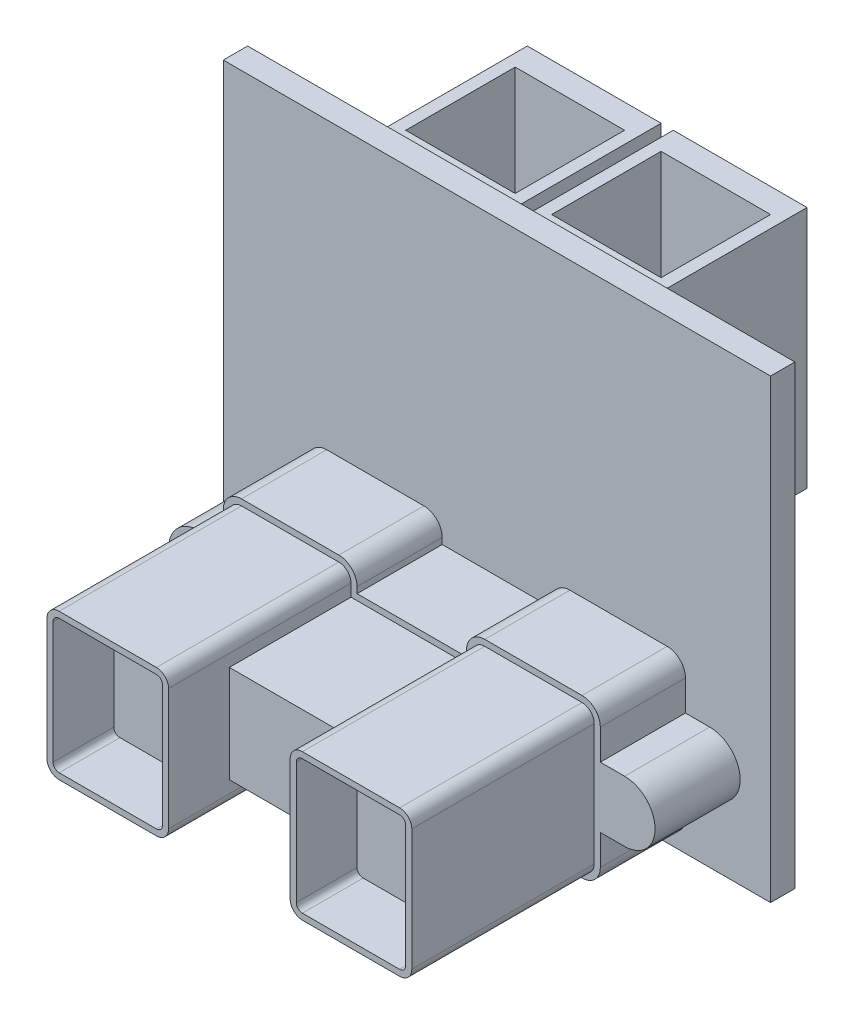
ISO-10303-21;
HEADER;
FILE_DESCRIPTION(('STEP AP214'),'2;1');
FILE_NAME('part.step','',(''),(''),'','','');
FILE_SCHEMA(('AUTOMOTIVE_DESIGN { 1 0 10303 214 1 1 1 1 }'));
ENDSEC;
DATA;
#1=APPLICATION_CONTEXT('core data for automotive mechanical design processes');
#2=APPLICATION_PROTOCOL_DEFINITION('international standard','automotive_design',2000,#1);
#3=PRODUCT_CONTEXT('',#1,'mechanical');
#4=PRODUCT('Part','Part','',(#3));
#5=PRODUCT_RELATED_PRODUCT_CATEGORY('part','',(#4));
#6=PRODUCT_DEFINITION_FORMATION('','',#4);
#7=PRODUCT_DEFINITION_CONTEXT('part definition',#1,'design');
#8=PRODUCT_DEFINITION('design','',#6,#7);
#9=PRODUCT_DEFINITION_SHAPE('','',#8);
#10=(LENGTH_UNIT() NAMED_UNIT(*) SI_UNIT(.MILLI.,.METRE.));
#11=(NAMED_UNIT(*) PLANE_ANGLE_UNIT() SI_UNIT($,.RADIAN.));
#12=(NAMED_UNIT(*) SI_UNIT($,.STERADIAN.) SOLID_ANGLE_UNIT());
#13=UNCERTAINTY_MEASURE_WITH_UNIT(LENGTH_MEASURE(1.E-05),#10,'distance_accuracy_value','');
#14=(GEOMETRIC_REPRESENTATION_CONTEXT(3) GLOBAL_UNCERTAINTY_ASSIGNED_CONTEXT((#13)) GLOBAL_UNIT_ASSIGNED_CONTEXT((#10,
#11,#12)) REPRESENTATION_CONTEXT('',''));
#15=CARTESIAN_POINT('',(0.,0.,0.));
#16=DIRECTION('',(0.,0.,1.));
#17=DIRECTION('',(1.,0.,0.));
#18=AXIS2_PLACEMENT_3D('',#15,#16,#17);
#19=CARTESIAN_POINT('',(0.,0.,0.));
#20=DIRECTION('',(0.,0.,1.));
#21=DIRECTION('',(1.,0.,0.));
#22=AXIS2_PLACEMENT_3D('',#19,#20,#21);
#23=PLANE('',#22);
#24=DIRECTION('',(-1.,0.,0.));
#25=VECTOR('',#24,1.);
#26=CARTESIAN_POINT('',(-0.5,-1.75,0.));
#27=LINE('',#26,#25);
#28=CARTESIAN_POINT('',(-0.5,-1.75,0.));
#29=VERTEX_POINT('',#28);
#30=CARTESIAN_POINT('',(-11.5,-1.75,0.));
#31=VERTEX_POINT('',#30);
#32=EDGE_CURVE('E655',#29,#31,#27,.T.);
#33=ORIENTED_EDGE('',*,*,#32,.F.);
#34=DIRECTION('',(0.,-1.,0.));
#35=VECTOR('',#34,1.);
#36=CARTESIAN_POINT('',(-0.499999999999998,18.25,0.));
#37=LINE('',#36,#35);
#38=CARTESIAN_POINT('',(-0.499999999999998,18.25,0.));
#39=VERTEX_POINT('',#38);
#40=EDGE_CURVE('E660',#39,#29,#37,.T.);
#41=ORIENTED_EDGE('',*,*,#40,.F.);
#42=DIRECTION('',(1.,0.,0.));
#43=VECTOR('',#42,1.);
#44=CARTESIAN_POINT('',(-11.5,18.25,0.));
#45=LINE('',#44,#43);
#46=CARTESIAN_POINT('',(-11.5,18.25,0.));
#47=VERTEX_POINT('',#46);
#48=EDGE_CURVE('E672',#47,#39,#45,.T.);
#49=ORIENTED_EDGE('',*,*,#48,.F.);
#50=DIRECTION('',(0.,1.,0.));
#51=VECTOR('',#50,1.);
#52=CARTESIAN_POINT('',(-11.5,18.25,0.));
#53=LINE('',#52,#51);
#54=EDGE_CURVE('E669',#31,#47,#53,.T.);
#55=ORIENTED_EDGE('',*,*,#54,.F.);
#56=EDGE_LOOP('',(#33,#41,#49,#55));
#57=FACE_BOUND('',#56,.T.);
#58=DIRECTION('',(0.,1.,0.));
#59=VECTOR('',#58,1.);
#60=CARTESIAN_POINT('',(22.5,18.75,0.));
#61=LINE('',#60,#59);
#62=CARTESIAN_POINT('',(22.5,-18.75,0.));
#63=VERTEX_POINT('',#62);
#64=CARTESIAN_POINT('',(22.5,18.75,0.));
#65=VERTEX_POINT('',#64);
#66=EDGE_CURVE('E1118',#63,#65,#61,.T.);
#67=ORIENTED_EDGE('',*,*,#66,.F.);
#68=DIRECTION('',(1.,0.,0.));
#69=VECTOR('',#68,1.);
#70=CARTESIAN_POINT('',(-22.5,-18.75,0.));
#71=LINE('',#70,#69);
#72=CARTESIAN_POINT('',(-22.5,-18.75,0.));
#73=VERTEX_POINT('',#72);
#74=EDGE_CURVE('E1111',#73,#63,#71,.T.);
#75=ORIENTED_EDGE('',*,*,#74,.F.);
#76=DIRECTION('',(0.,-1.,0.));
#77=VECTOR('',#76,1.);
#78=CARTESIAN_POINT('',(-22.5,18.75,0.));
#79=LINE('',#78,#77);
#80=CARTESIAN_POINT('',(-22.5,18.75,0.));
#81=VERTEX_POINT('',#80);
#82=EDGE_CURVE('E1123',#81,#73,#79,.T.);
#83=ORIENTED_EDGE('',*,*,#82,.F.);
#84=DIRECTION('',(-1.,0.,0.));
#85=VECTOR('',#84,1.);
#86=CARTESIAN_POINT('',(-22.5,18.75,0.));
#87=LINE('',#86,#85);
#88=EDGE_CURVE('E1121',#65,#81,#87,.T.);
#89=ORIENTED_EDGE('',*,*,#88,.F.);
#90=EDGE_LOOP('',(#67,#75,#83,#89));
#91=FACE_BOUND('',#90,.T.);
#92=DIRECTION('',(1.,0.,0.));
#93=VECTOR('',#92,1.);
#94=CARTESIAN_POINT('',(11.5,18.25,0.));
#95=LINE('',#94,#93);
#96=CARTESIAN_POINT('',(0.500000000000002,18.25,0.));
#97=VERTEX_POINT('',#96);
#98=CARTESIAN_POINT('',(11.5,18.25,0.));
#99=VERTEX_POINT('',#98);
#100=EDGE_CURVE('E617',#97,#99,#95,.T.);
#101=ORIENTED_EDGE('',*,*,#100,.F.);
#102=DIRECTION('',(0.,1.,0.));
#103=VECTOR('',#102,1.);
#104=CARTESIAN_POINT('',(0.500000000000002,18.25,0.));
#105=LINE('',#104,#103);
#106=CARTESIAN_POINT('',(0.5,-1.75,0.));
#107=VERTEX_POINT('',#106);
#108=EDGE_CURVE('E627',#107,#97,#105,.T.);
#109=ORIENTED_EDGE('',*,*,#108,.F.);
#110=DIRECTION('',(-1.,0.,0.));
#111=VECTOR('',#110,1.);
#112=CARTESIAN_POINT('',(0.5,-1.75,0.));
#113=LINE('',#112,#111);
#114=CARTESIAN_POINT('',(11.5,-1.75,0.));
#115=VERTEX_POINT('',#114);
#116=EDGE_CURVE('E639',#115,#107,#113,.T.);
#117=ORIENTED_EDGE('',*,*,#116,.F.);
#118=DIRECTION('',(0.,-1.,0.));
#119=VECTOR('',#118,1.);
#120=CARTESIAN_POINT('',(11.5,18.25,0.));
#121=LINE('',#120,#119);
#122=EDGE_CURVE('E636',#99,#115,#121,.T.);
#123=ORIENTED_EDGE('',*,*,#122,.F.);
#124=EDGE_LOOP('',(#101,#109,#117,#123));
#125=FACE_BOUND('',#124,.T.);
#126=ADVANCED_FACE('F34',(#57,#91,#125),#23,.F.);
#127=CARTESIAN_POINT('',(0.,0.,9.));
#128=DIRECTION('',(0.,0.,1.));
#129=DIRECTION('',(1.,0.,0.));
#130=AXIS2_PLACEMENT_3D('',#127,#128,#129);
#131=PLANE('',#130);
#132=DIRECTION('',(-1.,0.,0.));
#133=VECTOR('',#132,1.);
#134=CARTESIAN_POINT('',(5.,-7.24999999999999,9.));
#135=LINE('',#134,#133);
#136=CARTESIAN_POINT('',(5.,-7.24999999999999,9.));
#137=VERTEX_POINT('',#136);
#138=CARTESIAN_POINT('',(-5.,-7.24999999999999,9.));
#139=VERTEX_POINT('',#138);
#140=EDGE_CURVE('E1052',#137,#139,#135,.T.);
#141=ORIENTED_EDGE('',*,*,#140,.F.);
#142=DIRECTION('',(0.,-1.,0.));
#143=VECTOR('',#142,1.);
#144=CARTESIAN_POINT('',(5.,-7.24999999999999,9.));
#145=LINE('',#144,#143);
#146=CARTESIAN_POINT('',(5.,-6.24999999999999,9.));
#147=VERTEX_POINT('',#146);
#148=EDGE_CURVE('E1023',#147,#137,#145,.T.);
#149=ORIENTED_EDGE('',*,*,#148,.F.);
#150=CARTESIAN_POINT('',(6.,-6.24999999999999,9.));
#151=DIRECTION('',(0.,0.,1.));
#152=DIRECTION('',(1.,0.,0.));
#153=AXIS2_PLACEMENT_3D('',#150,#151,#152);
#154=CIRCLE('',#153,1.);
#155=CARTESIAN_POINT('',(6.,-5.24999999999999,9.));
#156=VERTEX_POINT('',#155);
#157=EDGE_CURVE('E42',#147,#156,#154,.F.);
#158=ORIENTED_EDGE('',*,*,#157,.T.);
#159=DIRECTION('',(-1.,0.,0.));
#160=VECTOR('',#159,1.);
#161=CARTESIAN_POINT('',(5.,-5.24999999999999,9.));
#162=LINE('',#161,#160);
#163=CARTESIAN_POINT('',(14.,-5.24999999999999,9.));
#164=VERTEX_POINT('',#163);
#165=EDGE_CURVE('E1028',#164,#156,#162,.T.);
#166=ORIENTED_EDGE('',*,*,#165,.F.);
#167=CARTESIAN_POINT('',(14.,-6.24999999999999,9.));
#168=DIRECTION('',(0.,0.,1.));
#169=DIRECTION('',(1.,0.,0.));
#170=AXIS2_PLACEMENT_3D('',#167,#168,#169);
#171=CIRCLE('',#170,1.);
#172=CARTESIAN_POINT('',(15.,-6.24999999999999,9.));
#173=VERTEX_POINT('',#172);
#174=EDGE_CURVE('E1205',#164,#173,#171,.F.);
#175=ORIENTED_EDGE('',*,*,#174,.T.);
#176=DIRECTION('',(0.,1.,0.));
#177=VECTOR('',#176,1.);
#178=CARTESIAN_POINT('',(15.,-5.24999999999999,9.));
#179=LINE('',#178,#177);
#180=CARTESIAN_POINT('',(15.,-16.25,9.));
#181=VERTEX_POINT('',#180);
#182=EDGE_CURVE('E1079',#181,#173,#179,.T.);
#183=ORIENTED_EDGE('',*,*,#182,.F.);
#184=CARTESIAN_POINT('',(14.,-16.25,9.));
#185=DIRECTION('',(0.,0.,1.));
#186=DIRECTION('',(1.,0.,0.));
#187=AXIS2_PLACEMENT_3D('',#184,#185,#186);
#188=CIRCLE('',#187,1.);
#189=CARTESIAN_POINT('',(14.,-17.25,9.));
#190=VERTEX_POINT('',#189);
#191=EDGE_CURVE('E1203',#181,#190,#188,.F.);
#192=ORIENTED_EDGE('',*,*,#191,.T.);
#193=DIRECTION('',(1.,0.,0.));
#194=VECTOR('',#193,1.);
#195=CARTESIAN_POINT('',(5.,-17.25,9.));
#196=LINE('',#195,#194);
#197=CARTESIAN_POINT('',(6.,-17.25,9.));
#198=VERTEX_POINT('',#197);
#199=EDGE_CURVE('E1076',#198,#190,#196,.T.);
#200=ORIENTED_EDGE('',*,*,#199,.F.);
#201=CARTESIAN_POINT('',(6.,-16.25,9.));
#202=DIRECTION('',(0.,0.,1.));
#203=DIRECTION('',(1.,0.,0.));
#204=AXIS2_PLACEMENT_3D('',#201,#202,#203);
#205=CIRCLE('',#204,1.);
#206=CARTESIAN_POINT('',(5.,-16.25,9.));
#207=VERTEX_POINT('',#206);
#208=EDGE_CURVE('E1199',#198,#207,#205,.F.);
#209=ORIENTED_EDGE('',*,*,#208,.T.);
#210=DIRECTION('',(0.,-1.,0.));
#211=VECTOR('',#210,1.);
#212=CARTESIAN_POINT('',(5.,-15.25,9.));
#213=LINE('',#212,#211);
#214=CARTESIAN_POINT('',(5.,-15.25,9.));
#215=VERTEX_POINT('',#214);
#216=EDGE_CURVE('E1073',#215,#207,#213,.T.);
#217=ORIENTED_EDGE('',*,*,#216,.F.);
#218=DIRECTION('',(1.,0.,0.));
#219=VECTOR('',#218,1.);
#220=CARTESIAN_POINT('',(5.,-15.25,9.));
#221=LINE('',#220,#219);
#222=CARTESIAN_POINT('',(-5.,-15.25,9.));
#223=VERTEX_POINT('',#222);
#224=EDGE_CURVE('E1070',#223,#215,#221,.T.);
#225=ORIENTED_EDGE('',*,*,#224,.F.);
#226=DIRECTION('',(0.,1.,0.));
#227=VECTOR('',#226,1.);
#228=CARTESIAN_POINT('',(-5.,-15.25,9.));
#229=LINE('',#228,#227);
#230=CARTESIAN_POINT('',(-5.,-16.25,9.));
#231=VERTEX_POINT('',#230);
#232=EDGE_CURVE('E1067',#231,#223,#229,.T.);
#233=ORIENTED_EDGE('',*,*,#232,.F.);
#234=CARTESIAN_POINT('',(-6.,-16.25,9.));
#235=DIRECTION('',(0.,0.,1.));
#236=DIRECTION('',(1.,0.,0.));
#237=AXIS2_PLACEMENT_3D('',#234,#235,#236);
#238=CIRCLE('',#237,1.);
#239=CARTESIAN_POINT('',(-6.,-17.25,9.));
#240=VERTEX_POINT('',#239);
#241=EDGE_CURVE('E1197',#231,#240,#238,.F.);
#242=ORIENTED_EDGE('',*,*,#241,.T.);
#243=DIRECTION('',(1.,0.,0.));
#244=VECTOR('',#243,1.);
#245=CARTESIAN_POINT('',(-5.,-17.25,9.));
#246=LINE('',#245,#244);
#247=CARTESIAN_POINT('',(-14.,-17.25,9.));
#248=VERTEX_POINT('',#247);
#249=EDGE_CURVE('E1064',#248,#240,#246,.T.);
#250=ORIENTED_EDGE('',*,*,#249,.F.);
#251=CARTESIAN_POINT('',(-14.,-16.25,9.));
#252=DIRECTION('',(0.,0.,1.));
#253=DIRECTION('',(1.,0.,0.));
#254=AXIS2_PLACEMENT_3D('',#251,#252,#253);
#255=CIRCLE('',#254,1.);
#256=CARTESIAN_POINT('',(-15.,-16.25,9.));
#257=VERTEX_POINT('',#256);
#258=EDGE_CURVE('E1195',#248,#257,#255,.F.);
#259=ORIENTED_EDGE('',*,*,#258,.T.);
#260=DIRECTION('',(0.,-1.,0.));
#261=VECTOR('',#260,1.);
#262=CARTESIAN_POINT('',(-15.,-5.25,9.));
#263=LINE('',#262,#261);
#264=CARTESIAN_POINT('',(-15.,-6.25,9.));
#265=VERTEX_POINT('',#264);
#266=EDGE_CURVE('E1061',#265,#257,#263,.T.);
#267=ORIENTED_EDGE('',*,*,#266,.F.);
#268=CARTESIAN_POINT('',(-14.,-6.25,9.));
#269=DIRECTION('',(0.,0.,1.));
#270=DIRECTION('',(1.,0.,0.));
#271=AXIS2_PLACEMENT_3D('',#268,#269,#270);
#272=CIRCLE('',#271,1.);
#273=CARTESIAN_POINT('',(-14.,-5.25,9.));
#274=VERTEX_POINT('',#273);
#275=EDGE_CURVE('E1201',#265,#274,#272,.F.);
#276=ORIENTED_EDGE('',*,*,#275,.T.);
#277=DIRECTION('',(-1.,0.,0.));
#278=VECTOR('',#277,1.);
#279=CARTESIAN_POINT('',(-5.,-5.24999999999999,9.));
#280=LINE('',#279,#278);
#281=CARTESIAN_POINT('',(-6.,-5.24999999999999,9.));
#282=VERTEX_POINT('',#281);
#283=EDGE_CURVE('E1058',#282,#274,#280,.T.);
#284=ORIENTED_EDGE('',*,*,#283,.F.);
#285=CARTESIAN_POINT('',(-6.,-6.24999999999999,9.));
#286=DIRECTION('',(0.,0.,1.));
#287=DIRECTION('',(1.,0.,0.));
#288=AXIS2_PLACEMENT_3D('',#285,#286,#287);
#289=CIRCLE('',#288,1.);
#290=CARTESIAN_POINT('',(-5.,-6.24999999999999,9.));
#291=VERTEX_POINT('',#290);
#292=EDGE_CURVE('E11',#282,#291,#289,.F.);
#293=ORIENTED_EDGE('',*,*,#292,.T.);
#294=DIRECTION('',(0.,1.,0.));
#295=VECTOR('',#294,1.);
#296=CARTESIAN_POINT('',(-5.,-7.24999999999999,9.));
#297=LINE('',#296,#295);
#298=EDGE_CURVE('E1055',#139,#291,#297,.T.);
#299=ORIENTED_EDGE('',*,*,#298,.F.);
#300=EDGE_LOOP('',(#141,#149,#158,#166,#175,#183,#192,#200,#209,#217,#225,#233,#242,#250,#259,
#267,#276,#284,#293,#299));
#301=FACE_BOUND('',#300,.T.);
#302=DIRECTION('',(1.,0.,0.));
#303=VECTOR('',#302,1.);
#304=CARTESIAN_POINT('',(-20.,-17.75,9.));
#305=LINE('',#304,#303);
#306=CARTESIAN_POINT('',(-14.,-17.75,9.));
#307=VERTEX_POINT('',#306);
#308=CARTESIAN_POINT('',(-6.,-17.75,9.));
#309=VERTEX_POINT('',#308);
#310=EDGE_CURVE('E1100',#307,#309,#305,.T.);
#311=ORIENTED_EDGE('',*,*,#310,.T.);
#312=CARTESIAN_POINT('',(-6.,-16.25,9.));
#313=DIRECTION('',(0.,0.,1.));
#314=DIRECTION('',(1.,0.,0.));
#315=AXIS2_PLACEMENT_3D('',#312,#313,#314);
#316=CIRCLE('',#315,1.5);
#317=CARTESIAN_POINT('',(-4.5,-16.25,9.));
#318=VERTEX_POINT('',#317);
#319=EDGE_CURVE('E765',#309,#318,#316,.T.);
#320=ORIENTED_EDGE('',*,*,#319,.T.);
#321=DIRECTION('',(0.,1.,0.));
#322=VECTOR('',#321,1.);
#323=CARTESIAN_POINT('',(-4.5,-16.25,9.));
#324=LINE('',#323,#322);
#325=CARTESIAN_POINT('',(-4.5,-15.75,9.));
#326=VERTEX_POINT('',#325);
#327=EDGE_CURVE('E768',#318,#326,#324,.T.);
#328=ORIENTED_EDGE('',*,*,#327,.T.);
#329=DIRECTION('',(1.,0.,0.));
#330=VECTOR('',#329,1.);
#331=CARTESIAN_POINT('',(-4.5,-15.75,9.));
#332=LINE('',#331,#330);
#333=CARTESIAN_POINT('',(4.5,-15.75,9.));
#334=VERTEX_POINT('',#333);
#335=EDGE_CURVE('E771',#326,#334,#332,.T.);
#336=ORIENTED_EDGE('',*,*,#335,.T.);
#337=DIRECTION('',(0.,-1.,0.));
#338=VECTOR('',#337,1.);
#339=CARTESIAN_POINT('',(4.5,-15.75,9.));
#340=LINE('',#339,#338);
#341=CARTESIAN_POINT('',(4.5,-16.25,9.));
#342=VERTEX_POINT('',#341);
#343=EDGE_CURVE('E774',#334,#342,#340,.T.);
#344=ORIENTED_EDGE('',*,*,#343,.T.);
#345=CARTESIAN_POINT('',(6.,-16.25,9.));
#346=DIRECTION('',(0.,0.,1.));
#347=DIRECTION('',(1.,0.,0.));
#348=AXIS2_PLACEMENT_3D('',#345,#346,#347);
#349=CIRCLE('',#348,1.5);
#350=CARTESIAN_POINT('',(6.,-17.75,9.));
#351=VERTEX_POINT('',#350);
#352=EDGE_CURVE('E777',#342,#351,#349,.T.);
#353=ORIENTED_EDGE('',*,*,#352,.T.);
#354=CARTESIAN_POINT('',(14.,-17.75,9.));
#355=VERTEX_POINT('',#354);
#356=EDGE_CURVE('E1097',#351,#355,#305,.T.);
#357=ORIENTED_EDGE('',*,*,#356,.T.);
#358=CARTESIAN_POINT('',(14.,-16.25,9.));
#359=DIRECTION('',(0.,0.,1.));
#360=DIRECTION('',(1.,0.,0.));
#361=AXIS2_PLACEMENT_3D('',#358,#359,#360);
#362=CIRCLE('',#361,1.5);
#363=CARTESIAN_POINT('',(15.5,-16.25,9.));
#364=VERTEX_POINT('',#363);
#365=EDGE_CURVE('E780',#355,#364,#362,.T.);
#366=ORIENTED_EDGE('',*,*,#365,.T.);
#367=DIRECTION('',(0.,1.,0.));
#368=VECTOR('',#367,1.);
#369=CARTESIAN_POINT('',(15.5,-13.75,9.));
#370=LINE('',#369,#368);
#371=CARTESIAN_POINT('',(15.5,-13.75,9.));
#372=VERTEX_POINT('',#371);
#373=EDGE_CURVE('E783',#364,#372,#370,.T.);
#374=ORIENTED_EDGE('',*,*,#373,.T.);
#375=DIRECTION('',(1.,0.,0.));
#376=VECTOR('',#375,1.);
#377=CARTESIAN_POINT('',(17.5,-13.75,9.));
#378=LINE('',#377,#376);
#379=CARTESIAN_POINT('',(17.5,-13.75,9.));
#380=VERTEX_POINT('',#379);
#381=EDGE_CURVE('E786',#372,#380,#378,.T.);
#382=ORIENTED_EDGE('',*,*,#381,.T.);
#383=CARTESIAN_POINT('',(17.5,-11.25,9.));
#384=DIRECTION('',(0.,0.,1.));
#385=DIRECTION('',(-1.,0.,0.));
#386=AXIS2_PLACEMENT_3D('',#383,#384,#385);
#387=CIRCLE('',#386,2.5);
#388=CARTESIAN_POINT('',(17.5,-8.75,9.));
#389=VERTEX_POINT('',#388);
#390=EDGE_CURVE('E789',#380,#389,#387,.T.);
#391=ORIENTED_EDGE('',*,*,#390,.T.);
#392=DIRECTION('',(-1.,0.,0.));
#393=VECTOR('',#392,1.);
#394=CARTESIAN_POINT('',(17.5,-8.75,9.));
#395=LINE('',#394,#393);
#396=CARTESIAN_POINT('',(15.5,-8.75,9.));
#397=VERTEX_POINT('',#396);
#398=EDGE_CURVE('E791',#389,#397,#395,.T.);
#399=ORIENTED_EDGE('',*,*,#398,.T.);
#400=DIRECTION('',(0.,1.,0.));
#401=VECTOR('',#400,1.);
#402=CARTESIAN_POINT('',(15.5,-8.75,9.));
#403=LINE('',#402,#401);
#404=CARTESIAN_POINT('',(15.5,-6.24999999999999,9.));
#405=VERTEX_POINT('',#404);
#406=EDGE_CURVE('E794',#397,#405,#403,.T.);
#407=ORIENTED_EDGE('',*,*,#406,.T.);
#408=CARTESIAN_POINT('',(14.,-6.24999999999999,9.));
#409=DIRECTION('',(0.,0.,1.));
#410=DIRECTION('',(1.,0.,0.));
#411=AXIS2_PLACEMENT_3D('',#408,#409,#410);
#412=CIRCLE('',#411,1.5);
#413=CARTESIAN_POINT('',(14.,-4.74999999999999,9.));
#414=VERTEX_POINT('',#413);
#415=EDGE_CURVE('E797',#405,#414,#412,.T.);
#416=ORIENTED_EDGE('',*,*,#415,.T.);
#417=DIRECTION('',(-1.,0.,0.));
#418=VECTOR('',#417,1.);
#419=CARTESIAN_POINT('',(-20.,-4.75,9.));
#420=LINE('',#419,#418);
#421=CARTESIAN_POINT('',(6.,-4.74999999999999,9.));
#422=VERTEX_POINT('',#421);
#423=EDGE_CURVE('E1095',#414,#422,#420,.T.);
#424=ORIENTED_EDGE('',*,*,#423,.T.);
#425=CARTESIAN_POINT('',(6.,-6.24999999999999,9.));
#426=DIRECTION('',(0.,0.,1.));
#427=DIRECTION('',(1.,0.,0.));
#428=AXIS2_PLACEMENT_3D('',#425,#426,#427);
#429=CIRCLE('',#428,1.5);
#430=CARTESIAN_POINT('',(4.5,-6.24999999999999,9.));
#431=VERTEX_POINT('',#430);
#432=EDGE_CURVE('E800',#422,#431,#429,.T.);
#433=ORIENTED_EDGE('',*,*,#432,.T.);
#434=DIRECTION('',(0.,-1.,0.));
#435=VECTOR('',#434,1.);
#436=CARTESIAN_POINT('',(4.5,-6.24999999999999,9.));
#437=LINE('',#436,#435);
#438=CARTESIAN_POINT('',(4.5,-6.74999999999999,9.));
#439=VERTEX_POINT('',#438);
#440=EDGE_CURVE('E803',#431,#439,#437,.T.);
#441=ORIENTED_EDGE('',*,*,#440,.T.);
#442=DIRECTION('',(-1.,0.,0.));
#443=VECTOR('',#442,1.);
#444=CARTESIAN_POINT('',(4.5,-6.74999999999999,9.));
#445=LINE('',#444,#443);
#446=CARTESIAN_POINT('',(-4.5,-6.74999999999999,9.));
#447=VERTEX_POINT('',#446);
#448=EDGE_CURVE('E806',#439,#447,#445,.T.);
#449=ORIENTED_EDGE('',*,*,#448,.T.);
#450=DIRECTION('',(0.,1.,0.));
#451=VECTOR('',#450,1.);
#452=CARTESIAN_POINT('',(-4.5,-6.74999999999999,9.));
#453=LINE('',#452,#451);
#454=CARTESIAN_POINT('',(-4.5,-6.24999999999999,9.));
#455=VERTEX_POINT('',#454);
#456=EDGE_CURVE('E809',#447,#455,#453,.T.);
#457=ORIENTED_EDGE('',*,*,#456,.T.);
#458=CARTESIAN_POINT('',(-6.,-6.24999999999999,9.));
#459=DIRECTION('',(0.,0.,1.));
#460=DIRECTION('',(1.,0.,0.));
#461=AXIS2_PLACEMENT_3D('',#458,#459,#460);
#462=CIRCLE('',#461,1.5);
#463=CARTESIAN_POINT('',(-6.,-4.74999999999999,9.));
#464=VERTEX_POINT('',#463);
#465=EDGE_CURVE('E812',#455,#464,#462,.T.);
#466=ORIENTED_EDGE('',*,*,#465,.T.);
#467=CARTESIAN_POINT('',(-14.,-4.75,9.));
#468=VERTEX_POINT('',#467);
#469=EDGE_CURVE('E1092',#464,#468,#420,.T.);
#470=ORIENTED_EDGE('',*,*,#469,.T.);
#471=CARTESIAN_POINT('',(-14.,-6.25,9.));
#472=DIRECTION('',(0.,0.,1.));
#473=DIRECTION('',(1.,0.,0.));
#474=AXIS2_PLACEMENT_3D('',#471,#472,#473);
#475=CIRCLE('',#474,1.5);
#476=CARTESIAN_POINT('',(-15.5,-6.25,9.));
#477=VERTEX_POINT('',#476);
#478=EDGE_CURVE('E815',#468,#477,#475,.T.);
#479=ORIENTED_EDGE('',*,*,#478,.T.);
#480=DIRECTION('',(0.,-1.,0.));
#481=VECTOR('',#480,1.);
#482=CARTESIAN_POINT('',(-15.5,-8.75,9.));
#483=LINE('',#482,#481);
#484=CARTESIAN_POINT('',(-15.5,-8.75,9.));
#485=VERTEX_POINT('',#484);
#486=EDGE_CURVE('E818',#477,#485,#483,.T.);
#487=ORIENTED_EDGE('',*,*,#486,.T.);
#488=DIRECTION('',(-1.,0.,0.));
#489=VECTOR('',#488,1.);
#490=CARTESIAN_POINT('',(-17.5,-8.75,9.));
#491=LINE('',#490,#489);
#492=CARTESIAN_POINT('',(-17.5,-8.75,9.));
#493=VERTEX_POINT('',#492);
#494=EDGE_CURVE('E821',#485,#493,#491,.T.);
#495=ORIENTED_EDGE('',*,*,#494,.T.);
#496=CARTESIAN_POINT('',(-17.5,-11.25,9.));
#497=DIRECTION('',(0.,0.,1.));
#498=DIRECTION('',(-1.,0.,0.));
#499=AXIS2_PLACEMENT_3D('',#496,#497,#498);
#500=CIRCLE('',#499,2.5);
#501=CARTESIAN_POINT('',(-17.5,-13.75,9.));
#502=VERTEX_POINT('',#501);
#503=EDGE_CURVE('E688',#493,#502,#500,.T.);
#504=ORIENTED_EDGE('',*,*,#503,.T.);
#505=DIRECTION('',(1.,0.,0.));
#506=VECTOR('',#505,1.);
#507=CARTESIAN_POINT('',(-17.5,-13.75,9.));
#508=LINE('',#507,#506);
#509=CARTESIAN_POINT('',(-15.5,-13.75,9.));
#510=VERTEX_POINT('',#509);
#511=EDGE_CURVE('E756',#502,#510,#508,.T.);
#512=ORIENTED_EDGE('',*,*,#511,.T.);
#513=DIRECTION('',(0.,-1.,0.));
#514=VECTOR('',#513,1.);
#515=CARTESIAN_POINT('',(-15.5,-13.75,9.));
#516=LINE('',#515,#514);
#517=CARTESIAN_POINT('',(-15.5,-16.25,9.));
#518=VERTEX_POINT('',#517);
#519=EDGE_CURVE('E759',#510,#518,#516,.T.);
#520=ORIENTED_EDGE('',*,*,#519,.T.);
#521=CARTESIAN_POINT('',(-14.,-16.25,9.));
#522=DIRECTION('',(0.,0.,1.));
#523=DIRECTION('',(1.,0.,0.));
#524=AXIS2_PLACEMENT_3D('',#521,#522,#523);
#525=CIRCLE('',#524,1.5);
#526=EDGE_CURVE('E762',#518,#307,#525,.T.);
#527=ORIENTED_EDGE('',*,*,#526,.T.);
#528=EDGE_LOOP('',(#311,#320,#328,#336,#344,#353,#357,#366,#374,#382,#391,#399,#407,#416,#424,
#433,#441,#449,#457,#466,#470,#479,#487,#495,#504,#512,#520,#527));
#529=FACE_BOUND('',#528,.T.);
#530=ADVANCED_FACE('F1210',(#301,#529),#131,.T.);
#531=CARTESIAN_POINT('',(-20.,-4.75,9.));
#532=DIRECTION('',(0.,-1.,0.));
#533=DIRECTION('',(0.,0.,-1.));
#534=AXIS2_PLACEMENT_3D('',#531,#532,#533);
#535=PLANE('',#534);
#536=DIRECTION('',(0.,0.,1.));
#537=VECTOR('',#536,1.);
#538=CARTESIAN_POINT('',(14.,-4.74999999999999,-41.3243580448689));
#539=LINE('',#538,#537);
#540=CARTESIAN_POINT('',(14.,-4.74999999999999,2.));
#541=VERTEX_POINT('',#540);
#542=EDGE_CURVE('E847',#541,#414,#539,.T.);
#543=ORIENTED_EDGE('',*,*,#542,.F.);
#544=DIRECTION('',(-1.,0.,0.));
#545=VECTOR('',#544,1.);
#546=CARTESIAN_POINT('',(-20.,-4.75,2.));
#547=LINE('',#546,#545);
#548=CARTESIAN_POINT('',(6.,-4.75,2.));
#549=VERTEX_POINT('',#548);
#550=EDGE_CURVE('E1103',#541,#549,#547,.T.);
#551=ORIENTED_EDGE('',*,*,#550,.T.);
#552=DIRECTION('',(0.,0.,1.));
#553=VECTOR('',#552,1.);
#554=CARTESIAN_POINT('',(6.,-4.74999999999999,-41.3243580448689));
#555=LINE('',#554,#553);
#556=EDGE_CURVE('E844',#549,#422,#555,.T.);
#557=ORIENTED_EDGE('',*,*,#556,.T.);
#558=ORIENTED_EDGE('',*,*,#423,.F.);
#559=EDGE_LOOP('',(#543,#551,#557,#558));
#560=FACE_BOUND('',#559,.T.);
#561=ADVANCED_FACE('F1317',(#560),#535,.F.);
#562=DIRECTION('',(0.,0.,1.));
#563=VECTOR('',#562,1.);
#564=CARTESIAN_POINT('',(-6.,-4.74999999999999,-41.3243580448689));
#565=LINE('',#564,#563);
#566=CARTESIAN_POINT('',(-6.,-4.74999999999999,2.));
#567=VERTEX_POINT('',#566);
#568=EDGE_CURVE('E834',#567,#464,#565,.T.);
#569=ORIENTED_EDGE('',*,*,#568,.F.);
#570=CARTESIAN_POINT('',(-14.,-4.75,2.));
#571=VERTEX_POINT('',#570);
#572=EDGE_CURVE('E1091',#567,#571,#547,.T.);
#573=ORIENTED_EDGE('',*,*,#572,.T.);
#574=DIRECTION('',(0.,0.,1.));
#575=VECTOR('',#574,1.);
#576=CARTESIAN_POINT('',(-14.,-4.75,-41.3243580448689));
#577=LINE('',#576,#575);
#578=EDGE_CURVE('E831',#571,#468,#577,.T.);
#579=ORIENTED_EDGE('',*,*,#578,.T.);
#580=ORIENTED_EDGE('',*,*,#469,.F.);
#581=EDGE_LOOP('',(#569,#573,#579,#580));
#582=FACE_BOUND('',#581,.T.);
#583=ADVANCED_FACE('F1624',(#582),#535,.F.);
#584=CARTESIAN_POINT('',(-20.,-17.75,9.));
#585=DIRECTION('',(0.,1.,0.));
#586=DIRECTION('',(0.,0.,1.));
#587=AXIS2_PLACEMENT_3D('',#584,#585,#586);
#588=PLANE('',#587);
#589=DIRECTION('',(0.,0.,1.));
#590=VECTOR('',#589,1.);
#591=CARTESIAN_POINT('',(-14.,-17.75,-41.3243580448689));
#592=LINE('',#591,#590);
#593=CARTESIAN_POINT('',(-14.,-17.75,2.));
#594=VERTEX_POINT('',#593);
#595=EDGE_CURVE('E878',#594,#307,#592,.T.);
#596=ORIENTED_EDGE('',*,*,#595,.F.);
#597=DIRECTION('',(1.,0.,0.));
#598=VECTOR('',#597,1.);
#599=CARTESIAN_POINT('',(-20.,-17.75,2.));
#600=LINE('',#599,#598);
#601=CARTESIAN_POINT('',(-6.,-17.75,2.));
#602=VERTEX_POINT('',#601);
#603=EDGE_CURVE('E1096',#594,#602,#600,.T.);
#604=ORIENTED_EDGE('',*,*,#603,.T.);
#605=DIRECTION('',(0.,0.,1.));
#606=VECTOR('',#605,1.);
#607=CARTESIAN_POINT('',(-6.,-17.75,-41.3243580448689));
#608=LINE('',#607,#606);
#609=EDGE_CURVE('E875',#602,#309,#608,.T.);
#610=ORIENTED_EDGE('',*,*,#609,.T.);
#611=ORIENTED_EDGE('',*,*,#310,.F.);
#612=EDGE_LOOP('',(#596,#604,#610,#611));
#613=FACE_BOUND('',#612,.T.);
#614=ADVANCED_FACE('F1633',(#613),#588,.F.);
#615=DIRECTION('',(0.,0.,1.));
#616=VECTOR('',#615,1.);
#617=CARTESIAN_POINT('',(6.,-17.75,-41.3243580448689));
#618=LINE('',#617,#616);
#619=CARTESIAN_POINT('',(6.,-17.75,2.));
#620=VERTEX_POINT('',#619);
#621=EDGE_CURVE('E865',#620,#351,#618,.T.);
#622=ORIENTED_EDGE('',*,*,#621,.F.);
#623=CARTESIAN_POINT('',(14.,-17.75,2.));
#624=VERTEX_POINT('',#623);
#625=EDGE_CURVE('E1104',#620,#624,#600,.T.);
#626=ORIENTED_EDGE('',*,*,#625,.T.);
#627=DIRECTION('',(0.,0.,1.));
#628=VECTOR('',#627,1.);
#629=CARTESIAN_POINT('',(14.,-17.75,-41.3243580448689));
#630=LINE('',#629,#628);
#631=EDGE_CURVE('E862',#624,#355,#630,.T.);
#632=ORIENTED_EDGE('',*,*,#631,.T.);
#633=ORIENTED_EDGE('',*,*,#356,.F.);
#634=EDGE_LOOP('',(#622,#626,#632,#633));
#635=FACE_BOUND('',#634,.T.);
#636=ADVANCED_FACE('F1369',(#635),#588,.F.);
#637=CARTESIAN_POINT('',(0.,0.,24.));
#638=DIRECTION('',(0.,0.,-1.));
#639=DIRECTION('',(-1.,0.,0.));
#640=AXIS2_PLACEMENT_3D('',#637,#638,#639);
#641=PLANE('',#640);
#642=CARTESIAN_POINT('',(6.,-16.25,24.));
#643=DIRECTION('',(0.,0.,1.));
#644=DIRECTION('',(1.,0.,0.));
#645=AXIS2_PLACEMENT_3D('',#642,#643,#644);
#646=CIRCLE('',#645,0.5);
#647=CARTESIAN_POINT('',(5.5,-16.25,24.));
#648=VERTEX_POINT('',#647);
#649=CARTESIAN_POINT('',(6.,-16.75,24.));
#650=VERTEX_POINT('',#649);
#651=EDGE_CURVE('E692',#648,#650,#646,.T.);
#652=ORIENTED_EDGE('',*,*,#651,.F.);
#653=DIRECTION('',(0.,-1.,0.));
#654=VECTOR('',#653,1.);
#655=CARTESIAN_POINT('',(5.5,-7.74999999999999,24.));
#656=LINE('',#655,#654);
#657=CARTESIAN_POINT('',(5.5,-6.24999999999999,24.));
#658=VERTEX_POINT('',#657);
#659=EDGE_CURVE('E957',#658,#648,#656,.T.);
#660=ORIENTED_EDGE('',*,*,#659,.F.);
#661=CARTESIAN_POINT('',(6.,-6.24999999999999,24.));
#662=DIRECTION('',(0.,0.,1.));
#663=DIRECTION('',(1.,0.,0.));
#664=AXIS2_PLACEMENT_3D('',#661,#662,#663);
#665=CIRCLE('',#664,0.5);
#666=CARTESIAN_POINT('',(6.,-5.74999999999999,24.));
#667=VERTEX_POINT('',#666);
#668=EDGE_CURVE('E996',#667,#658,#665,.T.);
#669=ORIENTED_EDGE('',*,*,#668,.F.);
#670=DIRECTION('',(-1.,0.,0.));
#671=VECTOR('',#670,1.);
#672=CARTESIAN_POINT('',(14.,-5.74999999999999,24.));
#673=LINE('',#672,#671);
#674=CARTESIAN_POINT('',(14.,-5.74999999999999,24.));
#675=VERTEX_POINT('',#674);
#676=EDGE_CURVE('E993',#675,#667,#673,.T.);
#677=ORIENTED_EDGE('',*,*,#676,.F.);
#678=CARTESIAN_POINT('',(14.,-6.24999999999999,24.));
#679=DIRECTION('',(0.,0.,1.));
#680=DIRECTION('',(1.,0.,0.));
#681=AXIS2_PLACEMENT_3D('',#678,#679,#680);
#682=CIRCLE('',#681,0.5);
#683=CARTESIAN_POINT('',(14.5,-6.24999999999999,24.));
#684=VERTEX_POINT('',#683);
#685=EDGE_CURVE('E990',#684,#675,#682,.T.);
#686=ORIENTED_EDGE('',*,*,#685,.F.);
#687=DIRECTION('',(0.,1.,0.));
#688=VECTOR('',#687,1.);
#689=CARTESIAN_POINT('',(14.5,-16.25,24.));
#690=LINE('',#689,#688);
#691=CARTESIAN_POINT('',(14.5,-16.25,24.));
#692=VERTEX_POINT('',#691);
#693=EDGE_CURVE('E987',#692,#684,#690,.T.);
#694=ORIENTED_EDGE('',*,*,#693,.F.);
#695=CARTESIAN_POINT('',(14.,-16.25,24.));
#696=DIRECTION('',(0.,0.,1.));
#697=DIRECTION('',(1.,0.,0.));
#698=AXIS2_PLACEMENT_3D('',#695,#696,#697);
#699=CIRCLE('',#698,0.5);
#700=CARTESIAN_POINT('',(14.,-16.75,24.));
#701=VERTEX_POINT('',#700);
#702=EDGE_CURVE('E984',#701,#692,#699,.T.);
#703=ORIENTED_EDGE('',*,*,#702,.F.);
#704=DIRECTION('',(1.,0.,0.));
#705=VECTOR('',#704,1.);
#706=CARTESIAN_POINT('',(6.,-16.75,24.));
#707=LINE('',#706,#705);
#708=EDGE_CURVE('E981',#650,#701,#707,.T.);
#709=ORIENTED_EDGE('',*,*,#708,.F.);
#710=EDGE_LOOP('',(#652,#660,#669,#677,#686,#694,#703,#709));
#711=FACE_BOUND('',#710,.T.);
#712=CARTESIAN_POINT('',(6.,-6.24999999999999,24.));
#713=DIRECTION('',(0.,0.,-1.));
#714=DIRECTION('',(-1.,0.,0.));
#715=AXIS2_PLACEMENT_3D('',#712,#713,#714);
#716=CIRCLE('',#715,1.);
#717=CARTESIAN_POINT('',(6.,-5.24999999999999,24.));
#718=VERTEX_POINT('',#717);
#719=CARTESIAN_POINT('',(5.,-6.24999999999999,24.));
#720=VERTEX_POINT('',#719);
#721=EDGE_CURVE('E1149',#718,#720,#716,.F.);
#722=ORIENTED_EDGE('',*,*,#721,.T.);
#723=DIRECTION('',(0.,-1.,0.));
#724=VECTOR('',#723,1.);
#725=CARTESIAN_POINT('',(5.,-15.25,24.));
#726=LINE('',#725,#724);
#727=CARTESIAN_POINT('',(5.,-16.25,24.));
#728=VERTEX_POINT('',#727);
#729=EDGE_CURVE('E1037',#720,#728,#726,.T.);
#730=ORIENTED_EDGE('',*,*,#729,.T.);
#731=CARTESIAN_POINT('',(6.,-16.25,24.));
#732=DIRECTION('',(0.,0.,-1.));
#733=DIRECTION('',(-1.,0.,0.));
#734=AXIS2_PLACEMENT_3D('',#731,#732,#733);
#735=CIRCLE('',#734,1.);
#736=CARTESIAN_POINT('',(6.,-17.25,24.));
#737=VERTEX_POINT('',#736);
#738=EDGE_CURVE('E1158',#728,#737,#735,.F.);
#739=ORIENTED_EDGE('',*,*,#738,.T.);
#740=DIRECTION('',(1.,0.,0.));
#741=VECTOR('',#740,1.);
#742=CARTESIAN_POINT('',(5.,-17.25,24.));
#743=LINE('',#742,#741);
#744=CARTESIAN_POINT('',(14.,-17.25,24.));
#745=VERTEX_POINT('',#744);
#746=EDGE_CURVE('E1040',#737,#745,#743,.T.);
#747=ORIENTED_EDGE('',*,*,#746,.T.);
#748=CARTESIAN_POINT('',(14.,-16.25,24.));
#749=DIRECTION('',(0.,0.,-1.));
#750=DIRECTION('',(-1.,0.,0.));
#751=AXIS2_PLACEMENT_3D('',#748,#749,#750);
#752=CIRCLE('',#751,1.);
#753=CARTESIAN_POINT('',(15.,-16.25,24.));
#754=VERTEX_POINT('',#753);
#755=EDGE_CURVE('E1154',#745,#754,#752,.F.);
#756=ORIENTED_EDGE('',*,*,#755,.T.);
#757=DIRECTION('',(0.,1.,0.));
#758=VECTOR('',#757,1.);
#759=CARTESIAN_POINT('',(15.,-5.24999999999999,24.));
#760=LINE('',#759,#758);
#761=CARTESIAN_POINT('',(15.,-6.24999999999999,24.));
#762=VERTEX_POINT('',#761);
#763=EDGE_CURVE('E1043',#754,#762,#760,.T.);
#764=ORIENTED_EDGE('',*,*,#763,.T.);
#765=CARTESIAN_POINT('',(14.,-6.24999999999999,24.));
#766=DIRECTION('',(0.,0.,-1.));
#767=DIRECTION('',(-1.,0.,0.));
#768=AXIS2_PLACEMENT_3D('',#765,#766,#767);
#769=CIRCLE('',#768,1.);
#770=CARTESIAN_POINT('',(14.,-5.24999999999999,24.));
#771=VERTEX_POINT('',#770);
#772=EDGE_CURVE('E1152',#762,#771,#769,.F.);
#773=ORIENTED_EDGE('',*,*,#772,.T.);
#774=DIRECTION('',(-1.,0.,0.));
#775=VECTOR('',#774,1.);
#776=CARTESIAN_POINT('',(5.,-5.24999999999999,24.));
#777=LINE('',#776,#775);
#778=EDGE_CURVE('E1046',#771,#718,#777,.T.);
#779=ORIENTED_EDGE('',*,*,#778,.T.);
#780=EDGE_LOOP('',(#722,#730,#739,#747,#756,#764,#773,#779));
#781=FACE_BOUND('',#780,.T.);
#782=ADVANCED_FACE('F1222',(#711,#781),#641,.F.);
#783=CARTESIAN_POINT('',(0.,0.,2.));
#784=DIRECTION('',(0.,0.,1.));
#785=DIRECTION('',(1.,0.,0.));
#786=AXIS2_PLACEMENT_3D('',#783,#784,#785);
#787=PLANE('',#786);
#788=DIRECTION('',(0.,1.,0.));
#789=VECTOR('',#788,1.);
#790=CARTESIAN_POINT('',(22.5,18.75,2.));
#791=LINE('',#790,#789);
#792=CARTESIAN_POINT('',(22.5,-18.75,2.));
#793=VERTEX_POINT('',#792);
#794=CARTESIAN_POINT('',(22.5,18.75,2.));
#795=VERTEX_POINT('',#794);
#796=EDGE_CURVE('E1107',#793,#795,#791,.T.);
#797=ORIENTED_EDGE('',*,*,#796,.T.);
#798=DIRECTION('',(-1.,0.,0.));
#799=VECTOR('',#798,1.);
#800=CARTESIAN_POINT('',(-22.5,18.75,2.));
#801=LINE('',#800,#799);
#802=CARTESIAN_POINT('',(-22.5,18.75,2.));
#803=VERTEX_POINT('',#802);
#804=EDGE_CURVE('E1110',#795,#803,#801,.T.);
#805=ORIENTED_EDGE('',*,*,#804,.T.);
#806=DIRECTION('',(0.,-1.,0.));
#807=VECTOR('',#806,1.);
#808=CARTESIAN_POINT('',(-22.5,18.75,2.));
#809=LINE('',#808,#807);
#810=CARTESIAN_POINT('',(-22.5,-18.75,2.));
#811=VERTEX_POINT('',#810);
#812=EDGE_CURVE('E1113',#803,#811,#809,.T.);
#813=ORIENTED_EDGE('',*,*,#812,.T.);
#814=DIRECTION('',(1.,0.,0.));
#815=VECTOR('',#814,1.);
#816=CARTESIAN_POINT('',(-22.5,-18.75,2.));
#817=LINE('',#816,#815);
#818=EDGE_CURVE('E1115',#811,#793,#817,.T.);
#819=ORIENTED_EDGE('',*,*,#818,.T.);
#820=EDGE_LOOP('',(#797,#805,#813,#819));
#821=FACE_BOUND('',#820,.T.);
#822=DIRECTION('',(1.,0.,0.));
#823=VECTOR('',#822,1.);
#824=CARTESIAN_POINT('',(17.5,-8.75,2.));
#825=LINE('',#824,#823);
#826=CARTESIAN_POINT('',(15.5,-8.75,2.));
#827=VERTEX_POINT('',#826);
#828=CARTESIAN_POINT('',(17.5,-8.75,2.));
#829=VERTEX_POINT('',#828);
#830=EDGE_CURVE('E720',#827,#829,#825,.T.);
#831=ORIENTED_EDGE('',*,*,#830,.T.);
#832=CARTESIAN_POINT('',(17.5,-11.25,2.));
#833=DIRECTION('',(0.,0.,1.));
#834=DIRECTION('',(1.,0.,0.));
#835=AXIS2_PLACEMENT_3D('',#832,#833,#834);
#836=CIRCLE('',#835,2.5);
#837=CARTESIAN_POINT('',(17.5,-13.75,2.));
#838=VERTEX_POINT('',#837);
#839=EDGE_CURVE('E718',#829,#838,#836,.F.);
#840=ORIENTED_EDGE('',*,*,#839,.T.);
#841=DIRECTION('',(-1.,0.,0.));
#842=VECTOR('',#841,1.);
#843=CARTESIAN_POINT('',(17.5,-13.75,2.));
#844=LINE('',#843,#842);
#845=CARTESIAN_POINT('',(15.5,-13.75,2.));
#846=VERTEX_POINT('',#845);
#847=EDGE_CURVE('E715',#838,#846,#844,.T.);
#848=ORIENTED_EDGE('',*,*,#847,.T.);
#849=DIRECTION('',(0.,-1.,0.));
#850=VECTOR('',#849,1.);
#851=CARTESIAN_POINT('',(15.5,-13.75,2.));
#852=LINE('',#851,#850);
#853=CARTESIAN_POINT('',(15.5,-16.25,2.));
#854=VERTEX_POINT('',#853);
#855=EDGE_CURVE('E712',#846,#854,#852,.T.);
#856=ORIENTED_EDGE('',*,*,#855,.T.);
#857=CARTESIAN_POINT('',(14.,-16.25,2.));
#858=DIRECTION('',(0.,0.,1.));
#859=DIRECTION('',(1.,0.,0.));
#860=AXIS2_PLACEMENT_3D('',#857,#858,#859);
#861=CIRCLE('',#860,1.5);
#862=EDGE_CURVE('E710',#854,#624,#861,.F.);
#863=ORIENTED_EDGE('',*,*,#862,.T.);
#864=ORIENTED_EDGE('',*,*,#625,.F.);
#865=CARTESIAN_POINT('',(6.,-16.25,2.));
#866=DIRECTION('',(0.,0.,1.));
#867=DIRECTION('',(1.,0.,0.));
#868=AXIS2_PLACEMENT_3D('',#865,#866,#867);
#869=CIRCLE('',#868,1.5);
#870=CARTESIAN_POINT('',(4.5,-16.25,2.));
#871=VERTEX_POINT('',#870);
#872=EDGE_CURVE('E707',#620,#871,#869,.F.);
#873=ORIENTED_EDGE('',*,*,#872,.T.);
#874=DIRECTION('',(0.,1.,0.));
#875=VECTOR('',#874,1.);
#876=CARTESIAN_POINT('',(4.5,-15.75,2.));
#877=LINE('',#876,#875);
#878=CARTESIAN_POINT('',(4.5,-15.75,2.));
#879=VERTEX_POINT('',#878);
#880=EDGE_CURVE('E704',#871,#879,#877,.T.);
#881=ORIENTED_EDGE('',*,*,#880,.T.);
#882=DIRECTION('',(-1.,0.,0.));
#883=VECTOR('',#882,1.);
#884=CARTESIAN_POINT('',(-4.5,-15.75,2.));
#885=LINE('',#884,#883);
#886=CARTESIAN_POINT('',(-4.5,-15.75,2.));
#887=VERTEX_POINT('',#886);
#888=EDGE_CURVE('E701',#879,#887,#885,.T.);
#889=ORIENTED_EDGE('',*,*,#888,.T.);
#890=DIRECTION('',(0.,-1.,0.));
#891=VECTOR('',#890,1.);
#892=CARTESIAN_POINT('',(-4.5,-16.25,2.));
#893=LINE('',#892,#891);
#894=CARTESIAN_POINT('',(-4.5,-16.25,2.));
#895=VERTEX_POINT('',#894);
#896=EDGE_CURVE('E698',#887,#895,#893,.T.);
#897=ORIENTED_EDGE('',*,*,#896,.T.);
#898=CARTESIAN_POINT('',(-6.,-16.25,2.));
#899=DIRECTION('',(0.,0.,1.));
#900=DIRECTION('',(1.,0.,0.));
#901=AXIS2_PLACEMENT_3D('',#898,#899,#900);
#902=CIRCLE('',#901,1.5);
#903=EDGE_CURVE('E696',#895,#602,#902,.F.);
#904=ORIENTED_EDGE('',*,*,#903,.T.);
#905=ORIENTED_EDGE('',*,*,#603,.F.);
#906=CARTESIAN_POINT('',(-14.,-16.25,2.));
#907=DIRECTION('',(0.,0.,1.));
#908=DIRECTION('',(1.,0.,0.));
#909=AXIS2_PLACEMENT_3D('',#906,#907,#908);
#910=CIRCLE('',#909,1.5);
#911=CARTESIAN_POINT('',(-15.5,-16.25,2.));
#912=VERTEX_POINT('',#911);
#913=EDGE_CURVE('E693',#594,#912,#910,.F.);
#914=ORIENTED_EDGE('',*,*,#913,.T.);
#915=DIRECTION('',(0.,1.,0.));
#916=VECTOR('',#915,1.);
#917=CARTESIAN_POINT('',(-15.5,-13.75,2.));
#918=LINE('',#917,#916);
#919=CARTESIAN_POINT('',(-15.5,-13.75,2.));
#920=VERTEX_POINT('',#919);
#921=EDGE_CURVE('E689',#912,#920,#918,.T.);
#922=ORIENTED_EDGE('',*,*,#921,.T.);
#923=DIRECTION('',(-1.,0.,0.));
#924=VECTOR('',#923,1.);
#925=CARTESIAN_POINT('',(-17.5,-13.75,2.));
#926=LINE('',#925,#924);
#927=CARTESIAN_POINT('',(-17.5,-13.75,2.));
#928=VERTEX_POINT('',#927);
#929=EDGE_CURVE('E754',#920,#928,#926,.T.);
#930=ORIENTED_EDGE('',*,*,#929,.T.);
#931=CARTESIAN_POINT('',(-17.5,-11.25,2.));
#932=DIRECTION('',(0.,0.,1.));
#933=DIRECTION('',(1.,0.,0.));
#934=AXIS2_PLACEMENT_3D('',#931,#932,#933);
#935=CIRCLE('',#934,2.5);
#936=CARTESIAN_POINT('',(-17.5,-8.75,2.));
#937=VERTEX_POINT('',#936);
#938=EDGE_CURVE('E752',#928,#937,#935,.F.);
#939=ORIENTED_EDGE('',*,*,#938,.T.);
#940=DIRECTION('',(1.,0.,0.));
#941=VECTOR('',#940,1.);
#942=CARTESIAN_POINT('',(-17.5,-8.75,2.));
#943=LINE('',#942,#941);
#944=CARTESIAN_POINT('',(-15.5,-8.75,2.));
#945=VERTEX_POINT('',#944);
#946=EDGE_CURVE('E749',#937,#945,#943,.T.);
#947=ORIENTED_EDGE('',*,*,#946,.T.);
#948=DIRECTION('',(0.,1.,0.));
#949=VECTOR('',#948,1.);
#950=CARTESIAN_POINT('',(-15.5,-8.75,2.));
#951=LINE('',#950,#949);
#952=CARTESIAN_POINT('',(-15.5,-6.25,2.));
#953=VERTEX_POINT('',#952);
#954=EDGE_CURVE('E746',#945,#953,#951,.T.);
#955=ORIENTED_EDGE('',*,*,#954,.T.);
#956=CARTESIAN_POINT('',(-14.,-6.25,2.));
#957=DIRECTION('',(0.,0.,1.));
#958=DIRECTION('',(1.,0.,0.));
#959=AXIS2_PLACEMENT_3D('',#956,#957,#958);
#960=CIRCLE('',#959,1.5);
#961=EDGE_CURVE('E743',#953,#571,#960,.F.);
#962=ORIENTED_EDGE('',*,*,#961,.T.);
#963=ORIENTED_EDGE('',*,*,#572,.F.);
#964=CARTESIAN_POINT('',(-6.,-6.24999999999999,2.));
#965=DIRECTION('',(0.,0.,1.));
#966=DIRECTION('',(1.,0.,0.));
#967=AXIS2_PLACEMENT_3D('',#964,#965,#966);
#968=CIRCLE('',#967,1.5);
#969=CARTESIAN_POINT('',(-4.5,-6.24999999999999,2.));
#970=VERTEX_POINT('',#969);
#971=EDGE_CURVE('E740',#567,#970,#968,.F.);
#972=ORIENTED_EDGE('',*,*,#971,.T.);
#973=DIRECTION('',(0.,-1.,0.));
#974=VECTOR('',#973,1.);
#975=CARTESIAN_POINT('',(-4.5,-6.74999999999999,2.));
#976=LINE('',#975,#974);
#977=CARTESIAN_POINT('',(-4.5,-6.74999999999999,2.));
#978=VERTEX_POINT('',#977);
#979=EDGE_CURVE('E737',#970,#978,#976,.T.);
#980=ORIENTED_EDGE('',*,*,#979,.T.);
#981=DIRECTION('',(1.,0.,0.));
#982=VECTOR('',#981,1.);
#983=CARTESIAN_POINT('',(4.5,-6.74999999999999,2.));
#984=LINE('',#983,#982);
#985=CARTESIAN_POINT('',(4.5,-6.74999999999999,2.));
#986=VERTEX_POINT('',#985);
#987=EDGE_CURVE('E734',#978,#986,#984,.T.);
#988=ORIENTED_EDGE('',*,*,#987,.T.);
#989=DIRECTION('',(0.,1.,0.));
#990=VECTOR('',#989,1.);
#991=CARTESIAN_POINT('',(4.5,-6.24999999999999,2.));
#992=LINE('',#991,#990);
#993=CARTESIAN_POINT('',(4.5,-6.24999999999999,2.));
#994=VERTEX_POINT('',#993);
#995=EDGE_CURVE('E731',#986,#994,#992,.T.);
#996=ORIENTED_EDGE('',*,*,#995,.T.);
#997=CARTESIAN_POINT('',(6.,-6.24999999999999,2.));
#998=DIRECTION('',(0.,0.,1.));
#999=DIRECTION('',(1.,0.,0.));
#1000=AXIS2_PLACEMENT_3D('',#997,#998,#999);
#1001=CIRCLE('',#1000,1.5);
#1002=EDGE_CURVE('E729',#994,#549,#1001,.F.);
#1003=ORIENTED_EDGE('',*,*,#1002,.T.);
#1004=ORIENTED_EDGE('',*,*,#550,.F.);
#1005=CARTESIAN_POINT('',(14.,-6.24999999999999,2.));
#1006=DIRECTION('',(0.,0.,1.));
#1007=DIRECTION('',(1.,0.,0.));
#1008=AXIS2_PLACEMENT_3D('',#1005,#1006,#1007);
#1009=CIRCLE('',#1008,1.5);
#1010=CARTESIAN_POINT('',(15.5,-6.24999999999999,2.));
#1011=VERTEX_POINT('',#1010);
#1012=EDGE_CURVE('E726',#541,#1011,#1009,.F.);
#1013=ORIENTED_EDGE('',*,*,#1012,.T.);
#1014=DIRECTION('',(0.,-1.,0.));
#1015=VECTOR('',#1014,1.);
#1016=CARTESIAN_POINT('',(15.5,-8.75,2.));
#1017=LINE('',#1016,#1015);
#1018=EDGE_CURVE('E723',#1011,#827,#1017,.T.);
#1019=ORIENTED_EDGE('',*,*,#1018,.T.);
#1020=EDGE_LOOP('',(#831,#840,#848,#856,#863,#864,#873,#881,#889,#897,#904,#905,#914,#922,#930,
#939,#947,#955,#962,#963,#972,#980,#988,#996,#1003,#1004,#1013,#1019));
#1021=FACE_BOUND('',#1020,.T.);
#1022=ADVANCED_FACE('F1322',(#821,#1021),#787,.T.);
#1023=CARTESIAN_POINT('',(22.5,18.75,2.));
#1024=DIRECTION('',(-1.,0.,0.));
#1025=DIRECTION('',(0.,-1.,0.));
#1026=AXIS2_PLACEMENT_3D('',#1023,#1024,#1025);
#1027=PLANE('',#1026);
#1028=ORIENTED_EDGE('',*,*,#66,.T.);
#1029=DIRECTION('',(0.,0.,-1.));
#1030=VECTOR('',#1029,1.);
#1031=CARTESIAN_POINT('',(22.5,18.75,2.));
#1032=LINE('',#1031,#1030);
#1033=EDGE_CURVE('E1134',#795,#65,#1032,.T.);
#1034=ORIENTED_EDGE('',*,*,#1033,.F.);
#1035=ORIENTED_EDGE('',*,*,#796,.F.);
#1036=DIRECTION('',(0.,0.,-1.));
#1037=VECTOR('',#1036,1.);
#1038=CARTESIAN_POINT('',(22.5,-18.75,2.));
#1039=LINE('',#1038,#1037);
#1040=EDGE_CURVE('E1117',#793,#63,#1039,.T.);
#1041=ORIENTED_EDGE('',*,*,#1040,.T.);
#1042=EDGE_LOOP('',(#1028,#1034,#1035,#1041));
#1043=FACE_BOUND('',#1042,.T.);
#1044=ADVANCED_FACE('F1335',(#1043),#1027,.F.);
#1045=CARTESIAN_POINT('',(-22.5,18.75,2.));
#1046=DIRECTION('',(0.,-1.,0.));
#1047=DIRECTION('',(0.,0.,-1.));
#1048=AXIS2_PLACEMENT_3D('',#1045,#1046,#1047);
#1049=PLANE('',#1048);
#1050=ORIENTED_EDGE('',*,*,#88,.T.);
#1051=DIRECTION('',(0.,0.,-1.));
#1052=VECTOR('',#1051,1.);
#1053=CARTESIAN_POINT('',(-22.5,18.75,2.));
#1054=LINE('',#1053,#1052);
#1055=EDGE_CURVE('E1131',#803,#81,#1054,.T.);
#1056=ORIENTED_EDGE('',*,*,#1055,.F.);
#1057=ORIENTED_EDGE('',*,*,#804,.F.);
#1058=ORIENTED_EDGE('',*,*,#1033,.T.);
#1059=EDGE_LOOP('',(#1050,#1056,#1057,#1058));
#1060=FACE_BOUND('',#1059,.T.);
#1061=ADVANCED_FACE('F1331',(#1060),#1049,.F.);
#1062=CARTESIAN_POINT('',(-22.5,18.75,2.));
#1063=DIRECTION('',(1.,0.,0.));
#1064=DIRECTION('',(0.,1.,0.));
#1065=AXIS2_PLACEMENT_3D('',#1062,#1063,#1064);
#1066=PLANE('',#1065);
#1067=ORIENTED_EDGE('',*,*,#82,.T.);
#1068=DIRECTION('',(0.,0.,-1.));
#1069=VECTOR('',#1068,1.);
#1070=CARTESIAN_POINT('',(-22.5,-18.75,2.));
#1071=LINE('',#1070,#1069);
#1072=EDGE_CURVE('E1128',#811,#73,#1071,.T.);
#1073=ORIENTED_EDGE('',*,*,#1072,.F.);
#1074=ORIENTED_EDGE('',*,*,#812,.F.);
#1075=ORIENTED_EDGE('',*,*,#1055,.T.);
#1076=EDGE_LOOP('',(#1067,#1073,#1074,#1075));
#1077=FACE_BOUND('',#1076,.T.);
#1078=ADVANCED_FACE('F1327',(#1077),#1066,.F.);
#1079=CARTESIAN_POINT('',(-22.5,-18.75,2.));
#1080=DIRECTION('',(0.,1.,0.));
#1081=DIRECTION('',(0.,0.,1.));
#1082=AXIS2_PLACEMENT_3D('',#1079,#1080,#1081);
#1083=PLANE('',#1082);
#1084=ORIENTED_EDGE('',*,*,#74,.T.);
#1085=ORIENTED_EDGE('',*,*,#1040,.F.);
#1086=ORIENTED_EDGE('',*,*,#818,.F.);
#1087=ORIENTED_EDGE('',*,*,#1072,.T.);
#1088=EDGE_LOOP('',(#1084,#1085,#1086,#1087));
#1089=FACE_BOUND('',#1088,.T.);
#1090=ADVANCED_FACE('F1324',(#1089),#1083,.F.);
#1091=CARTESIAN_POINT('',(5.,-7.24999999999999,24.));
#1092=DIRECTION('',(1.,0.,0.));
#1093=DIRECTION('',(0.,0.,-1.));
#1094=AXIS2_PLACEMENT_3D('',#1091,#1092,#1093);
#1095=PLANE('',#1094);
#1096=ORIENTED_EDGE('',*,*,#729,.F.);
#1097=DIRECTION('',(0.,0.,-1.));
#1098=VECTOR('',#1097,1.);
#1099=CARTESIAN_POINT('',(5.,-6.24999999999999,24.));
#1100=LINE('',#1099,#1098);
#1101=EDGE_CURVE('E1190',#720,#147,#1100,.T.);
#1102=ORIENTED_EDGE('',*,*,#1101,.T.);
#1103=ORIENTED_EDGE('',*,*,#148,.T.);
#1104=DIRECTION('',(0.,0.,-1.));
#1105=VECTOR('',#1104,1.);
#1106=CARTESIAN_POINT('',(5.,-7.24999999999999,24.));
#1107=LINE('',#1106,#1105);
#1108=CARTESIAN_POINT('',(5.,-7.24999999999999,19.));
#1109=VERTEX_POINT('',#1108);
#1110=EDGE_CURVE('E1089',#1109,#137,#1107,.T.);
#1111=ORIENTED_EDGE('',*,*,#1110,.F.);
#1112=DIRECTION('',(0.,1.,0.));
#1113=VECTOR('',#1112,1.);
#1114=CARTESIAN_POINT('',(5.,-7.24999999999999,19.));
#1115=LINE('',#1114,#1113);
#1116=CARTESIAN_POINT('',(5.,-15.25,19.));
#1117=VERTEX_POINT('',#1116);
#1118=EDGE_CURVE('E1021',#1117,#1109,#1115,.T.);
#1119=ORIENTED_EDGE('',*,*,#1118,.F.);
#1120=DIRECTION('',(0.,0.,-1.));
#1121=VECTOR('',#1120,1.);
#1122=CARTESIAN_POINT('',(5.,-15.25,24.));
#1123=LINE('',#1122,#1121);
#1124=EDGE_CURVE('E1049',#1117,#215,#1123,.T.);
#1125=ORIENTED_EDGE('',*,*,#1124,.T.);
#1126=ORIENTED_EDGE('',*,*,#216,.T.);
#1127=DIRECTION('',(0.,0.,-1.));
#1128=VECTOR('',#1127,1.);
#1129=CARTESIAN_POINT('',(5.,-16.25,24.));
#1130=LINE('',#1129,#1128);
#1131=EDGE_CURVE('E1173',#207,#728,#1130,.F.);
#1132=ORIENTED_EDGE('',*,*,#1131,.T.);
#1133=EDGE_LOOP('',(#1096,#1102,#1103,#1111,#1119,#1125,#1126,#1132));
#1134=FACE_BOUND('',#1133,.T.);
#1135=ADVANCED_FACE('F1248',(#1134),#1095,.F.);
#1136=CARTESIAN_POINT('',(5.,-7.24999999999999,24.));
#1137=DIRECTION('',(0.,-1.,0.));
#1138=DIRECTION('',(1.,0.,0.));
#1139=AXIS2_PLACEMENT_3D('',#1136,#1137,#1138);
#1140=PLANE('',#1139);
#1141=DIRECTION('',(0.,0.,-1.));
#1142=VECTOR('',#1141,1.);
#1143=CARTESIAN_POINT('',(-5.,-7.24999999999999,24.));
#1144=LINE('',#1143,#1142);
#1145=CARTESIAN_POINT('',(-5.,-7.24999999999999,19.));
#1146=VERTEX_POINT('',#1145);
#1147=EDGE_CURVE('E1087',#1146,#139,#1144,.T.);
#1148=ORIENTED_EDGE('',*,*,#1147,.F.);
#1149=DIRECTION('',(-1.,0.,0.));
#1150=VECTOR('',#1149,1.);
#1151=CARTESIAN_POINT('',(-5.,-7.24999999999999,19.));
#1152=LINE('',#1151,#1150);
#1153=EDGE_CURVE('E938',#1109,#1146,#1152,.T.);
#1154=ORIENTED_EDGE('',*,*,#1153,.F.);
#1155=ORIENTED_EDGE('',*,*,#1110,.T.);
#1156=ORIENTED_EDGE('',*,*,#140,.T.);
#1157=EDGE_LOOP('',(#1148,#1154,#1155,#1156));
#1158=FACE_BOUND('',#1157,.T.);
#1159=ADVANCED_FACE('F1296',(#1158),#1140,.F.);
#1160=CARTESIAN_POINT('',(-5.,-7.24999999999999,24.));
#1161=DIRECTION('',(-1.,0.,0.));
#1162=DIRECTION('',(0.,0.,1.));
#1163=AXIS2_PLACEMENT_3D('',#1160,#1161,#1162);
#1164=PLANE('',#1163);
#1165=ORIENTED_EDGE('',*,*,#298,.T.);
#1166=DIRECTION('',(0.,0.,-1.));
#1167=VECTOR('',#1166,1.);
#1168=CARTESIAN_POINT('',(-5.,-6.24999999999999,24.));
#1169=LINE('',#1168,#1167);
#1170=CARTESIAN_POINT('',(-5.,-6.24999999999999,24.));
#1171=VERTEX_POINT('',#1170);
#1172=EDGE_CURVE('E1193',#291,#1171,#1169,.F.);
#1173=ORIENTED_EDGE('',*,*,#1172,.T.);
#1174=DIRECTION('',(0.,1.,0.));
#1175=VECTOR('',#1174,1.);
#1176=CARTESIAN_POINT('',(-5.,-7.24999999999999,24.));
#1177=LINE('',#1176,#1175);
#1178=CARTESIAN_POINT('',(-5.,-16.25,24.));
#1179=VERTEX_POINT('',#1178);
#1180=EDGE_CURVE('E1024',#1179,#1171,#1177,.T.);
#1181=ORIENTED_EDGE('',*,*,#1180,.F.);
#1182=DIRECTION('',(0.,0.,-1.));
#1183=VECTOR('',#1182,1.);
#1184=CARTESIAN_POINT('',(-5.,-16.25,24.));
#1185=LINE('',#1184,#1183);
#1186=EDGE_CURVE('E1165',#1179,#231,#1185,.T.);
#1187=ORIENTED_EDGE('',*,*,#1186,.T.);
#1188=ORIENTED_EDGE('',*,*,#232,.T.);
#1189=DIRECTION('',(0.,0.,-1.));
#1190=VECTOR('',#1189,1.);
#1191=CARTESIAN_POINT('',(-5.,-15.25,24.));
#1192=LINE('',#1191,#1190);
#1193=CARTESIAN_POINT('',(-5.,-15.25,19.));
#1194=VERTEX_POINT('',#1193);
#1195=EDGE_CURVE('E1085',#1194,#223,#1192,.T.);
#1196=ORIENTED_EDGE('',*,*,#1195,.F.);
#1197=DIRECTION('',(0.,-1.,0.));
#1198=VECTOR('',#1197,1.);
#1199=CARTESIAN_POINT('',(-5.,-15.25,19.));
#1200=LINE('',#1199,#1198);
#1201=EDGE_CURVE('E1017',#1146,#1194,#1200,.T.);
#1202=ORIENTED_EDGE('',*,*,#1201,.F.);
#1203=ORIENTED_EDGE('',*,*,#1147,.T.);
#1204=EDGE_LOOP('',(#1165,#1173,#1181,#1187,#1188,#1196,#1202,#1203));
#1205=FACE_BOUND('',#1204,.T.);
#1206=ADVANCED_FACE('F1259',(#1205),#1164,.F.);
#1207=CARTESIAN_POINT('',(-5.,-5.24999999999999,24.));
#1208=DIRECTION('',(0.,-1.,0.));
#1209=DIRECTION('',(1.,0.,0.));
#1210=AXIS2_PLACEMENT_3D('',#1207,#1208,#1209);
#1211=PLANE('',#1210);
#1212=ORIENTED_EDGE('',*,*,#283,.T.);
#1213=DIRECTION('',(0.,0.,-1.));
#1214=VECTOR('',#1213,1.);
#1215=CARTESIAN_POINT('',(-14.,-5.25,24.));
#1216=LINE('',#1215,#1214);
#1217=CARTESIAN_POINT('',(-14.,-5.25,24.));
#1218=VERTEX_POINT('',#1217);
#1219=EDGE_CURVE('E1178',#274,#1218,#1216,.F.);
#1220=ORIENTED_EDGE('',*,*,#1219,.T.);
#1221=DIRECTION('',(-1.,0.,0.));
#1222=VECTOR('',#1221,1.);
#1223=CARTESIAN_POINT('',(-5.,-5.24999999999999,24.));
#1224=LINE('',#1223,#1222);
#1225=CARTESIAN_POINT('',(-6.,-5.24999999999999,24.));
#1226=VERTEX_POINT('',#1225);
#1227=EDGE_CURVE('E1027',#1226,#1218,#1224,.T.);
#1228=ORIENTED_EDGE('',*,*,#1227,.F.);
#1229=DIRECTION('',(0.,0.,-1.));
#1230=VECTOR('',#1229,1.);
#1231=CARTESIAN_POINT('',(-6.,-5.24999999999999,24.));
#1232=LINE('',#1231,#1230);
#1233=EDGE_CURVE('E1175',#1226,#282,#1232,.T.);
#1234=ORIENTED_EDGE('',*,*,#1233,.T.);
#1235=EDGE_LOOP('',(#1212,#1220,#1228,#1234));
#1236=FACE_BOUND('',#1235,.T.);
#1237=ADVANCED_FACE('F1286',(#1236),#1211,.F.);
#1238=CARTESIAN_POINT('',(-15.,-5.25,24.));
#1239=DIRECTION('',(1.,0.,0.));
#1240=DIRECTION('',(0.,1.,0.));
#1241=AXIS2_PLACEMENT_3D('',#1238,#1239,#1240);
#1242=PLANE('',#1241);
#1243=ORIENTED_EDGE('',*,*,#266,.T.);
#1244=DIRECTION('',(0.,0.,-1.));
#1245=VECTOR('',#1244,1.);
#1246=CARTESIAN_POINT('',(-15.,-16.25,24.));
#1247=LINE('',#1246,#1245);
#1248=CARTESIAN_POINT('',(-15.,-16.25,24.));
#1249=VERTEX_POINT('',#1248);
#1250=EDGE_CURVE('E1145',#257,#1249,#1247,.F.);
#1251=ORIENTED_EDGE('',*,*,#1250,.T.);
#1252=DIRECTION('',(0.,-1.,0.));
#1253=VECTOR('',#1252,1.);
#1254=CARTESIAN_POINT('',(-15.,-5.25,24.));
#1255=LINE('',#1254,#1253);
#1256=CARTESIAN_POINT('',(-15.,-6.25,24.));
#1257=VERTEX_POINT('',#1256);
#1258=EDGE_CURVE('E1031',#1257,#1249,#1255,.T.);
#1259=ORIENTED_EDGE('',*,*,#1258,.F.);
#1260=DIRECTION('',(0.,0.,-1.));
#1261=VECTOR('',#1260,1.);
#1262=CARTESIAN_POINT('',(-15.,-6.25,24.));
#1263=LINE('',#1262,#1261);
#1264=EDGE_CURVE('E1142',#1257,#265,#1263,.T.);
#1265=ORIENTED_EDGE('',*,*,#1264,.T.);
#1266=EDGE_LOOP('',(#1243,#1251,#1259,#1265));
#1267=FACE_BOUND('',#1266,.T.);
#1268=ADVANCED_FACE('F1278',(#1267),#1242,.F.);
#1269=CARTESIAN_POINT('',(-5.,-17.25,24.));
#1270=DIRECTION('',(0.,1.,0.));
#1271=DIRECTION('',(0.,0.,1.));
#1272=AXIS2_PLACEMENT_3D('',#1269,#1270,#1271);
#1273=PLANE('',#1272);
#1274=DIRECTION('',(1.,0.,0.));
#1275=VECTOR('',#1274,1.);
#1276=CARTESIAN_POINT('',(-5.,-17.25,24.));
#1277=LINE('',#1276,#1275);
#1278=CARTESIAN_POINT('',(-14.,-17.25,24.));
#1279=VERTEX_POINT('',#1278);
#1280=CARTESIAN_POINT('',(-6.,-17.25,24.));
#1281=VERTEX_POINT('',#1280);
#1282=EDGE_CURVE('E1034',#1279,#1281,#1277,.T.);
#1283=ORIENTED_EDGE('',*,*,#1282,.F.);
#1284=DIRECTION('',(0.,0.,-1.));
#1285=VECTOR('',#1284,1.);
#1286=CARTESIAN_POINT('',(-14.,-17.25,24.));
#1287=LINE('',#1286,#1285);
#1288=EDGE_CURVE('E1139',#1279,#248,#1287,.T.);
#1289=ORIENTED_EDGE('',*,*,#1288,.T.);
#1290=ORIENTED_EDGE('',*,*,#249,.T.);
#1291=DIRECTION('',(0.,0.,-1.));
#1292=VECTOR('',#1291,1.);
#1293=CARTESIAN_POINT('',(-6.,-17.25,24.));
#1294=LINE('',#1293,#1292);
#1295=EDGE_CURVE('E1137',#240,#1281,#1294,.F.);
#1296=ORIENTED_EDGE('',*,*,#1295,.T.);
#1297=EDGE_LOOP('',(#1283,#1289,#1290,#1296));
#1298=FACE_BOUND('',#1297,.T.);
#1299=ADVANCED_FACE('F1267',(#1298),#1273,.F.);
#1300=CARTESIAN_POINT('',(5.,-15.25,24.));
#1301=DIRECTION('',(0.,1.,0.));
#1302=DIRECTION('',(-1.,0.,0.));
#1303=AXIS2_PLACEMENT_3D('',#1300,#1301,#1302);
#1304=PLANE('',#1303);
#1305=ORIENTED_EDGE('',*,*,#1124,.F.);
#1306=DIRECTION('',(1.,0.,0.));
#1307=VECTOR('',#1306,1.);
#1308=CARTESIAN_POINT('',(5.,-15.25,19.));
#1309=LINE('',#1308,#1307);
#1310=EDGE_CURVE('E1019',#1194,#1117,#1309,.T.);
#1311=ORIENTED_EDGE('',*,*,#1310,.F.);
#1312=ORIENTED_EDGE('',*,*,#1195,.T.);
#1313=ORIENTED_EDGE('',*,*,#224,.T.);
#1314=EDGE_LOOP('',(#1305,#1311,#1312,#1313));
#1315=FACE_BOUND('',#1314,.T.);
#1316=ADVANCED_FACE('F1254',(#1315),#1304,.F.);
#1317=CARTESIAN_POINT('',(5.,-17.25,24.));
#1318=DIRECTION('',(0.,1.,0.));
#1319=DIRECTION('',(-1.,0.,0.));
#1320=AXIS2_PLACEMENT_3D('',#1317,#1318,#1319);
#1321=PLANE('',#1320);
#1322=ORIENTED_EDGE('',*,*,#746,.F.);
#1323=DIRECTION('',(0.,0.,-1.));
#1324=VECTOR('',#1323,1.);
#1325=CARTESIAN_POINT('',(6.,-17.25,24.));
#1326=LINE('',#1325,#1324);
#1327=EDGE_CURVE('E1170',#737,#198,#1326,.T.);
#1328=ORIENTED_EDGE('',*,*,#1327,.T.);
#1329=ORIENTED_EDGE('',*,*,#199,.T.);
#1330=DIRECTION('',(0.,0.,-1.));
#1331=VECTOR('',#1330,1.);
#1332=CARTESIAN_POINT('',(14.,-17.25,24.));
#1333=LINE('',#1332,#1331);
#1334=EDGE_CURVE('E1168',#190,#745,#1333,.F.);
#1335=ORIENTED_EDGE('',*,*,#1334,.T.);
#1336=EDGE_LOOP('',(#1322,#1328,#1329,#1335));
#1337=FACE_BOUND('',#1336,.T.);
#1338=ADVANCED_FACE('F1240',(#1337),#1321,.F.);
#1339=CARTESIAN_POINT('',(15.,-5.24999999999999,24.));
#1340=DIRECTION('',(-1.,0.,0.));
#1341=DIRECTION('',(0.,-1.,0.));
#1342=AXIS2_PLACEMENT_3D('',#1339,#1340,#1341);
#1343=PLANE('',#1342);
#1344=ORIENTED_EDGE('',*,*,#763,.F.);
#1345=DIRECTION('',(0.,0.,-1.));
#1346=VECTOR('',#1345,1.);
#1347=CARTESIAN_POINT('',(15.,-16.25,24.));
#1348=LINE('',#1347,#1346);
#1349=EDGE_CURVE('E1182',#754,#181,#1348,.T.);
#1350=ORIENTED_EDGE('',*,*,#1349,.T.);
#1351=ORIENTED_EDGE('',*,*,#182,.T.);
#1352=DIRECTION('',(0.,0.,-1.));
#1353=VECTOR('',#1352,1.);
#1354=CARTESIAN_POINT('',(15.,-6.24999999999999,24.));
#1355=LINE('',#1354,#1353);
#1356=EDGE_CURVE('E1180',#173,#762,#1355,.F.);
#1357=ORIENTED_EDGE('',*,*,#1356,.T.);
#1358=EDGE_LOOP('',(#1344,#1350,#1351,#1357));
#1359=FACE_BOUND('',#1358,.T.);
#1360=ADVANCED_FACE('F1231',(#1359),#1343,.F.);
#1361=CARTESIAN_POINT('',(5.,-5.24999999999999,24.));
#1362=DIRECTION('',(0.,-1.,0.));
#1363=DIRECTION('',(1.,0.,0.));
#1364=AXIS2_PLACEMENT_3D('',#1361,#1362,#1363);
#1365=PLANE('',#1364);
#1366=ORIENTED_EDGE('',*,*,#778,.F.);
#1367=DIRECTION('',(0.,0.,-1.));
#1368=VECTOR('',#1367,1.);
#1369=CARTESIAN_POINT('',(14.,-5.24999999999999,24.));
#1370=LINE('',#1369,#1368);
#1371=EDGE_CURVE('E1187',#771,#164,#1370,.T.);
#1372=ORIENTED_EDGE('',*,*,#1371,.T.);
#1373=ORIENTED_EDGE('',*,*,#165,.T.);
#1374=DIRECTION('',(0.,0.,-1.));
#1375=VECTOR('',#1374,1.);
#1376=CARTESIAN_POINT('',(6.,-5.24999999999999,24.));
#1377=LINE('',#1376,#1375);
#1378=EDGE_CURVE('E1185',#156,#718,#1377,.F.);
#1379=ORIENTED_EDGE('',*,*,#1378,.T.);
#1380=EDGE_LOOP('',(#1366,#1372,#1373,#1379));
#1381=FACE_BOUND('',#1380,.T.);
#1382=ADVANCED_FACE('F1217',(#1381),#1365,.F.);
#1383=DIRECTION('',(0.,-1.,0.));
#1384=VECTOR('',#1383,1.);
#1385=CARTESIAN_POINT('',(-14.5,-6.25,24.));
#1386=LINE('',#1385,#1384);
#1387=CARTESIAN_POINT('',(-14.5,-6.25,24.));
#1388=VERTEX_POINT('',#1387);
#1389=CARTESIAN_POINT('',(-14.5,-16.25,24.));
#1390=VERTEX_POINT('',#1389);
#1391=EDGE_CURVE('E915',#1388,#1390,#1386,.T.);
#1392=ORIENTED_EDGE('',*,*,#1391,.F.);
#1393=CARTESIAN_POINT('',(-14.,-6.25,24.));
#1394=DIRECTION('',(0.,0.,1.));
#1395=DIRECTION('',(1.,0.,0.));
#1396=AXIS2_PLACEMENT_3D('',#1393,#1394,#1395);
#1397=CIRCLE('',#1396,0.5);
#1398=CARTESIAN_POINT('',(-14.,-5.75,24.));
#1399=VERTEX_POINT('',#1398);
#1400=EDGE_CURVE('E913',#1399,#1388,#1397,.T.);
#1401=ORIENTED_EDGE('',*,*,#1400,.F.);
#1402=DIRECTION('',(-1.,0.,0.));
#1403=VECTOR('',#1402,1.);
#1404=CARTESIAN_POINT('',(-6.,-5.74999999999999,24.));
#1405=LINE('',#1404,#1403);
#1406=CARTESIAN_POINT('',(-6.,-5.74999999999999,24.));
#1407=VERTEX_POINT('',#1406);
#1408=EDGE_CURVE('E892',#1407,#1399,#1405,.T.);
#1409=ORIENTED_EDGE('',*,*,#1408,.F.);
#1410=CARTESIAN_POINT('',(-6.,-6.24999999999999,24.));
#1411=DIRECTION('',(0.,0.,1.));
#1412=DIRECTION('',(1.,0.,0.));
#1413=AXIS2_PLACEMENT_3D('',#1410,#1411,#1412);
#1414=CIRCLE('',#1413,0.5);
#1415=CARTESIAN_POINT('',(-5.5,-6.24999999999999,24.));
#1416=VERTEX_POINT('',#1415);
#1417=EDGE_CURVE('E931',#1416,#1407,#1414,.T.);
#1418=ORIENTED_EDGE('',*,*,#1417,.F.);
#1419=DIRECTION('',(0.,1.,0.));
#1420=VECTOR('',#1419,1.);
#1421=CARTESIAN_POINT('',(-5.5,-7.74999999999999,24.));
#1422=LINE('',#1421,#1420);
#1423=CARTESIAN_POINT('',(-5.5,-16.25,24.));
#1424=VERTEX_POINT('',#1423);
#1425=EDGE_CURVE('E928',#1424,#1416,#1422,.T.);
#1426=ORIENTED_EDGE('',*,*,#1425,.F.);
#1427=CARTESIAN_POINT('',(-6.,-16.25,24.));
#1428=DIRECTION('',(0.,0.,1.));
#1429=DIRECTION('',(1.,0.,0.));
#1430=AXIS2_PLACEMENT_3D('',#1427,#1428,#1429);
#1431=CIRCLE('',#1430,0.5);
#1432=CARTESIAN_POINT('',(-6.,-16.75,24.));
#1433=VERTEX_POINT('',#1432);
#1434=EDGE_CURVE('E925',#1433,#1424,#1431,.T.);
#1435=ORIENTED_EDGE('',*,*,#1434,.F.);
#1436=DIRECTION('',(1.,0.,0.));
#1437=VECTOR('',#1436,1.);
#1438=CARTESIAN_POINT('',(-14.,-16.75,24.));
#1439=LINE('',#1438,#1437);
#1440=CARTESIAN_POINT('',(-14.,-16.75,24.));
#1441=VERTEX_POINT('',#1440);
#1442=EDGE_CURVE('E922',#1441,#1433,#1439,.T.);
#1443=ORIENTED_EDGE('',*,*,#1442,.F.);
#1444=CARTESIAN_POINT('',(-14.,-16.25,24.));
#1445=DIRECTION('',(0.,0.,1.));
#1446=DIRECTION('',(1.,0.,0.));
#1447=AXIS2_PLACEMENT_3D('',#1444,#1445,#1446);
#1448=CIRCLE('',#1447,0.5);
#1449=EDGE_CURVE('E919',#1390,#1441,#1448,.T.);
#1450=ORIENTED_EDGE('',*,*,#1449,.F.);
#1451=EDGE_LOOP('',(#1392,#1401,#1409,#1418,#1426,#1435,#1443,#1450));
#1452=FACE_BOUND('',#1451,.T.);
#1453=CARTESIAN_POINT('',(-6.,-16.25,24.));
#1454=DIRECTION('',(0.,0.,-1.));
#1455=DIRECTION('',(-1.,0.,0.));
#1456=AXIS2_PLACEMENT_3D('',#1453,#1454,#1455);
#1457=CIRCLE('',#1456,1.);
#1458=EDGE_CURVE('E1160',#1281,#1179,#1457,.F.);
#1459=ORIENTED_EDGE('',*,*,#1458,.T.);
#1460=ORIENTED_EDGE('',*,*,#1180,.T.);
#1461=CARTESIAN_POINT('',(-6.,-6.24999999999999,24.));
#1462=DIRECTION('',(0.,0.,-1.));
#1463=DIRECTION('',(-1.,0.,0.));
#1464=AXIS2_PLACEMENT_3D('',#1461,#1462,#1463);
#1465=CIRCLE('',#1464,1.);
#1466=EDGE_CURVE('E1147',#1171,#1226,#1465,.F.);
#1467=ORIENTED_EDGE('',*,*,#1466,.T.);
#1468=ORIENTED_EDGE('',*,*,#1227,.T.);
#1469=CARTESIAN_POINT('',(-14.,-6.25,24.));
#1470=DIRECTION('',(0.,0.,-1.));
#1471=DIRECTION('',(-1.,0.,0.));
#1472=AXIS2_PLACEMENT_3D('',#1469,#1470,#1471);
#1473=CIRCLE('',#1472,1.);
#1474=EDGE_CURVE('E1156',#1218,#1257,#1473,.F.);
#1475=ORIENTED_EDGE('',*,*,#1474,.T.);
#1476=ORIENTED_EDGE('',*,*,#1258,.T.);
#1477=CARTESIAN_POINT('',(-14.,-16.25,24.));
#1478=DIRECTION('',(0.,0.,-1.));
#1479=DIRECTION('',(-1.,0.,0.));
#1480=AXIS2_PLACEMENT_3D('',#1477,#1478,#1479);
#1481=CIRCLE('',#1480,1.);
#1482=EDGE_CURVE('E1163',#1249,#1279,#1481,.F.);
#1483=ORIENTED_EDGE('',*,*,#1482,.T.);
#1484=ORIENTED_EDGE('',*,*,#1282,.T.);
#1485=EDGE_LOOP('',(#1459,#1460,#1467,#1468,#1475,#1476,#1483,#1484));
#1486=FACE_BOUND('',#1485,.T.);
#1487=ADVANCED_FACE('F1270',(#1452,#1486),#641,.F.);
#1488=CARTESIAN_POINT('',(-14.,-16.25,24.));
#1489=DIRECTION('',(0.,0.,-1.));
#1490=DIRECTION('',(-1.,0.,0.));
#1491=AXIS2_PLACEMENT_3D('',#1488,#1489,#1490);
#1492=CYLINDRICAL_SURFACE('',#1491,1.);
#1493=ORIENTED_EDGE('',*,*,#1482,.F.);
#1494=ORIENTED_EDGE('',*,*,#1250,.F.);
#1495=ORIENTED_EDGE('',*,*,#258,.F.);
#1496=ORIENTED_EDGE('',*,*,#1288,.F.);
#1497=EDGE_LOOP('',(#1493,#1494,#1495,#1496));
#1498=FACE_BOUND('',#1497,.T.);
#1499=ADVANCED_FACE('F1275',(#1498),#1492,.T.);
#1500=CARTESIAN_POINT('',(-6.,-16.25,24.));
#1501=DIRECTION('',(0.,0.,-1.));
#1502=DIRECTION('',(-1.,0.,0.));
#1503=AXIS2_PLACEMENT_3D('',#1500,#1501,#1502);
#1504=CYLINDRICAL_SURFACE('',#1503,1.);
#1505=ORIENTED_EDGE('',*,*,#1458,.F.);
#1506=ORIENTED_EDGE('',*,*,#1295,.F.);
#1507=ORIENTED_EDGE('',*,*,#241,.F.);
#1508=ORIENTED_EDGE('',*,*,#1186,.F.);
#1509=EDGE_LOOP('',(#1505,#1506,#1507,#1508));
#1510=FACE_BOUND('',#1509,.T.);
#1511=ADVANCED_FACE('F1263',(#1510),#1504,.T.);
#1512=CARTESIAN_POINT('',(6.,-16.25,24.));
#1513=DIRECTION('',(0.,0.,-1.));
#1514=DIRECTION('',(-1.,0.,0.));
#1515=AXIS2_PLACEMENT_3D('',#1512,#1513,#1514);
#1516=CYLINDRICAL_SURFACE('',#1515,1.);
#1517=ORIENTED_EDGE('',*,*,#738,.F.);
#1518=ORIENTED_EDGE('',*,*,#1131,.F.);
#1519=ORIENTED_EDGE('',*,*,#208,.F.);
#1520=ORIENTED_EDGE('',*,*,#1327,.F.);
#1521=EDGE_LOOP('',(#1517,#1518,#1519,#1520));
#1522=FACE_BOUND('',#1521,.T.);
#1523=ADVANCED_FACE('F1243',(#1522),#1516,.T.);
#1524=CARTESIAN_POINT('',(-14.,-6.25,24.));
#1525=DIRECTION('',(0.,0.,-1.));
#1526=DIRECTION('',(-1.,0.,0.));
#1527=AXIS2_PLACEMENT_3D('',#1524,#1525,#1526);
#1528=CYLINDRICAL_SURFACE('',#1527,1.);
#1529=ORIENTED_EDGE('',*,*,#1474,.F.);
#1530=ORIENTED_EDGE('',*,*,#1219,.F.);
#1531=ORIENTED_EDGE('',*,*,#275,.F.);
#1532=ORIENTED_EDGE('',*,*,#1264,.F.);
#1533=EDGE_LOOP('',(#1529,#1530,#1531,#1532));
#1534=FACE_BOUND('',#1533,.T.);
#1535=ADVANCED_FACE('F1282',(#1534),#1528,.T.);
#1536=CARTESIAN_POINT('',(14.,-16.25,24.));
#1537=DIRECTION('',(0.,0.,-1.));
#1538=DIRECTION('',(-1.,0.,0.));
#1539=AXIS2_PLACEMENT_3D('',#1536,#1537,#1538);
#1540=CYLINDRICAL_SURFACE('',#1539,1.);
#1541=ORIENTED_EDGE('',*,*,#755,.F.);
#1542=ORIENTED_EDGE('',*,*,#1334,.F.);
#1543=ORIENTED_EDGE('',*,*,#191,.F.);
#1544=ORIENTED_EDGE('',*,*,#1349,.F.);
#1545=EDGE_LOOP('',(#1541,#1542,#1543,#1544));
#1546=FACE_BOUND('',#1545,.T.);
#1547=ADVANCED_FACE('F1235',(#1546),#1540,.T.);
#1548=CARTESIAN_POINT('',(14.,-6.24999999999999,24.));
#1549=DIRECTION('',(0.,0.,-1.));
#1550=DIRECTION('',(-1.,0.,0.));
#1551=AXIS2_PLACEMENT_3D('',#1548,#1549,#1550);
#1552=CYLINDRICAL_SURFACE('',#1551,1.);
#1553=ORIENTED_EDGE('',*,*,#772,.F.);
#1554=ORIENTED_EDGE('',*,*,#1356,.F.);
#1555=ORIENTED_EDGE('',*,*,#174,.F.);
#1556=ORIENTED_EDGE('',*,*,#1371,.F.);
#1557=EDGE_LOOP('',(#1553,#1554,#1555,#1556));
#1558=FACE_BOUND('',#1557,.T.);
#1559=ADVANCED_FACE('F1226',(#1558),#1552,.T.);
#1560=CARTESIAN_POINT('',(6.,-6.24999999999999,24.));
#1561=DIRECTION('',(0.,0.,-1.));
#1562=DIRECTION('',(-1.,0.,0.));
#1563=AXIS2_PLACEMENT_3D('',#1560,#1561,#1562);
#1564=CYLINDRICAL_SURFACE('',#1563,1.);
#1565=ORIENTED_EDGE('',*,*,#721,.F.);
#1566=ORIENTED_EDGE('',*,*,#1378,.F.);
#1567=ORIENTED_EDGE('',*,*,#157,.F.);
#1568=ORIENTED_EDGE('',*,*,#1101,.F.);
#1569=EDGE_LOOP('',(#1565,#1566,#1567,#1568));
#1570=FACE_BOUND('',#1569,.T.);
#1571=ADVANCED_FACE('F1220',(#1570),#1564,.T.);
#1572=CARTESIAN_POINT('',(-6.,-6.24999999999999,24.));
#1573=DIRECTION('',(0.,0.,-1.));
#1574=DIRECTION('',(-1.,0.,0.));
#1575=AXIS2_PLACEMENT_3D('',#1572,#1573,#1574);
#1576=CYLINDRICAL_SURFACE('',#1575,1.);
#1577=ORIENTED_EDGE('',*,*,#1466,.F.);
#1578=ORIENTED_EDGE('',*,*,#1172,.F.);
#1579=ORIENTED_EDGE('',*,*,#292,.F.);
#1580=ORIENTED_EDGE('',*,*,#1233,.F.);
#1581=EDGE_LOOP('',(#1577,#1578,#1579,#1580));
#1582=FACE_BOUND('',#1581,.T.);
#1583=ADVANCED_FACE('F36',(#1582),#1576,.T.);
#1584=CARTESIAN_POINT('',(0.,0.,19.));
#1585=DIRECTION('',(0.,0.,-1.));
#1586=DIRECTION('',(-1.,0.,0.));
#1587=AXIS2_PLACEMENT_3D('',#1584,#1585,#1586);
#1588=PLANE('',#1587);
#1589=ORIENTED_EDGE('',*,*,#1153,.T.);
#1590=ORIENTED_EDGE('',*,*,#1201,.T.);
#1591=ORIENTED_EDGE('',*,*,#1310,.T.);
#1592=ORIENTED_EDGE('',*,*,#1118,.T.);
#1593=EDGE_LOOP('',(#1589,#1590,#1591,#1592));
#1594=FACE_BOUND('',#1593,.T.);
#1595=ADVANCED_FACE('F1298',(#1594),#1588,.F.);
#1596=CARTESIAN_POINT('',(-14.,-6.25,19.));
#1597=DIRECTION('',(0.,0.,1.));
#1598=DIRECTION('',(1.,0.,0.));
#1599=AXIS2_PLACEMENT_3D('',#1596,#1597,#1598);
#1600=CYLINDRICAL_SURFACE('',#1599,0.5);
#1601=ORIENTED_EDGE('',*,*,#1400,.T.);
#1602=DIRECTION('',(0.,0.,1.));
#1603=VECTOR('',#1602,1.);
#1604=CARTESIAN_POINT('',(-14.5,-6.25,19.));
#1605=LINE('',#1604,#1603);
#1606=CARTESIAN_POINT('',(-14.5,-6.25,19.));
#1607=VERTEX_POINT('',#1606);
#1608=EDGE_CURVE('E912',#1607,#1388,#1605,.T.);
#1609=ORIENTED_EDGE('',*,*,#1608,.F.);
#1610=CARTESIAN_POINT('',(-14.,-6.25,19.));
#1611=DIRECTION('',(0.,0.,1.));
#1612=DIRECTION('',(1.,0.,0.));
#1613=AXIS2_PLACEMENT_3D('',#1610,#1611,#1612);
#1614=CIRCLE('',#1613,0.5);
#1615=CARTESIAN_POINT('',(-14.,-5.75,19.));
#1616=VERTEX_POINT('',#1615);
#1617=EDGE_CURVE('E888',#1616,#1607,#1614,.T.);
#1618=ORIENTED_EDGE('',*,*,#1617,.F.);
#1619=DIRECTION('',(0.,0.,1.));
#1620=VECTOR('',#1619,1.);
#1621=CARTESIAN_POINT('',(-14.,-5.75,19.));
#1622=LINE('',#1621,#1620);
#1623=EDGE_CURVE('E936',#1616,#1399,#1622,.T.);
#1624=ORIENTED_EDGE('',*,*,#1623,.T.);
#1625=EDGE_LOOP('',(#1601,#1609,#1618,#1624));
#1626=FACE_BOUND('',#1625,.T.);
#1627=ADVANCED_FACE('F1300',(#1626),#1600,.F.);
#1628=CARTESIAN_POINT('',(-6.,-5.74999999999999,19.));
#1629=DIRECTION('',(0.,1.,0.));
#1630=DIRECTION('',(-1.,0.,0.));
#1631=AXIS2_PLACEMENT_3D('',#1628,#1629,#1630);
#1632=PLANE('',#1631);
#1633=ORIENTED_EDGE('',*,*,#1408,.T.);
#1634=ORIENTED_EDGE('',*,*,#1623,.F.);
#1635=DIRECTION('',(-1.,0.,0.));
#1636=VECTOR('',#1635,1.);
#1637=CARTESIAN_POINT('',(-6.,-5.74999999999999,19.));
#1638=LINE('',#1637,#1636);
#1639=CARTESIAN_POINT('',(-6.,-5.74999999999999,19.));
#1640=VERTEX_POINT('',#1639);
#1641=EDGE_CURVE('E909',#1640,#1616,#1638,.T.);
#1642=ORIENTED_EDGE('',*,*,#1641,.F.);
#1643=DIRECTION('',(0.,0.,1.));
#1644=VECTOR('',#1643,1.);
#1645=CARTESIAN_POINT('',(-6.,-5.74999999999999,19.));
#1646=LINE('',#1645,#1644);
#1647=EDGE_CURVE('E939',#1640,#1407,#1646,.T.);
#1648=ORIENTED_EDGE('',*,*,#1647,.T.);
#1649=EDGE_LOOP('',(#1633,#1634,#1642,#1648));
#1650=FACE_BOUND('',#1649,.T.);
#1651=ADVANCED_FACE('F1306',(#1650),#1632,.F.);
#1652=CARTESIAN_POINT('',(-6.,-6.24999999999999,19.));
#1653=DIRECTION('',(0.,0.,1.));
#1654=DIRECTION('',(1.,0.,0.));
#1655=AXIS2_PLACEMENT_3D('',#1652,#1653,#1654);
#1656=CYLINDRICAL_SURFACE('',#1655,0.5);
#1657=ORIENTED_EDGE('',*,*,#1417,.T.);
#1658=ORIENTED_EDGE('',*,*,#1647,.F.);
#1659=CARTESIAN_POINT('',(-6.,-6.24999999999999,19.));
#1660=DIRECTION('',(0.,0.,1.));
#1661=DIRECTION('',(1.,0.,0.));
#1662=AXIS2_PLACEMENT_3D('',#1659,#1660,#1661);
#1663=CIRCLE('',#1662,0.5);
#1664=CARTESIAN_POINT('',(-5.5,-6.24999999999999,19.));
#1665=VERTEX_POINT('',#1664);
#1666=EDGE_CURVE('E906',#1665,#1640,#1663,.T.);
#1667=ORIENTED_EDGE('',*,*,#1666,.F.);
#1668=DIRECTION('',(0.,0.,1.));
#1669=VECTOR('',#1668,1.);
#1670=CARTESIAN_POINT('',(-5.5,-6.24999999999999,19.));
#1671=LINE('',#1670,#1669);
#1672=EDGE_CURVE('E941',#1665,#1416,#1671,.T.);
#1673=ORIENTED_EDGE('',*,*,#1672,.T.);
#1674=EDGE_LOOP('',(#1657,#1658,#1667,#1673));
#1675=FACE_BOUND('',#1674,.T.);
#1676=ADVANCED_FACE('F1442',(#1675),#1656,.F.);
#1677=CARTESIAN_POINT('',(-5.5,-7.74999999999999,19.));
#1678=DIRECTION('',(1.,0.,0.));
#1679=DIRECTION('',(0.,0.,-1.));
#1680=AXIS2_PLACEMENT_3D('',#1677,#1678,#1679);
#1681=PLANE('',#1680);
#1682=ORIENTED_EDGE('',*,*,#1425,.T.);
#1683=ORIENTED_EDGE('',*,*,#1672,.F.);
#1684=DIRECTION('',(0.,1.,0.));
#1685=VECTOR('',#1684,1.);
#1686=CARTESIAN_POINT('',(-5.5,-16.25,19.));
#1687=LINE('',#1686,#1685);
#1688=CARTESIAN_POINT('',(-5.5,-16.25,19.));
#1689=VERTEX_POINT('',#1688);
#1690=EDGE_CURVE('E904',#1689,#1665,#1687,.T.);
#1691=ORIENTED_EDGE('',*,*,#1690,.F.);
#1692=DIRECTION('',(0.,0.,1.));
#1693=VECTOR('',#1692,1.);
#1694=CARTESIAN_POINT('',(-5.5,-16.25,19.));
#1695=LINE('',#1694,#1693);
#1696=EDGE_CURVE('E943',#1689,#1424,#1695,.T.);
#1697=ORIENTED_EDGE('',*,*,#1696,.T.);
#1698=EDGE_LOOP('',(#1682,#1683,#1691,#1697));
#1699=FACE_BOUND('',#1698,.T.);
#1700=ADVANCED_FACE('F1452',(#1699),#1681,.F.);
#1701=CARTESIAN_POINT('',(-6.,-16.25,19.));
#1702=DIRECTION('',(0.,0.,1.));
#1703=DIRECTION('',(1.,0.,0.));
#1704=AXIS2_PLACEMENT_3D('',#1701,#1702,#1703);
#1705=CYLINDRICAL_SURFACE('',#1704,0.5);
#1706=ORIENTED_EDGE('',*,*,#1434,.T.);
#1707=ORIENTED_EDGE('',*,*,#1696,.F.);
#1708=CARTESIAN_POINT('',(-6.,-16.25,19.));
#1709=DIRECTION('',(0.,0.,1.));
#1710=DIRECTION('',(1.,0.,0.));
#1711=AXIS2_PLACEMENT_3D('',#1708,#1709,#1710);
#1712=CIRCLE('',#1711,0.5);
#1713=CARTESIAN_POINT('',(-6.,-16.75,19.));
#1714=VERTEX_POINT('',#1713);
#1715=EDGE_CURVE('E901',#1714,#1689,#1712,.T.);
#1716=ORIENTED_EDGE('',*,*,#1715,.F.);
#1717=DIRECTION('',(0.,0.,1.));
#1718=VECTOR('',#1717,1.);
#1719=CARTESIAN_POINT('',(-6.,-16.75,19.));
#1720=LINE('',#1719,#1718);
#1721=EDGE_CURVE('E945',#1714,#1433,#1720,.T.);
#1722=ORIENTED_EDGE('',*,*,#1721,.T.);
#1723=EDGE_LOOP('',(#1706,#1707,#1716,#1722));
#1724=FACE_BOUND('',#1723,.T.);
#1725=ADVANCED_FACE('F1463',(#1724),#1705,.F.);
#1726=CARTESIAN_POINT('',(-14.,-16.75,19.));
#1727=DIRECTION('',(0.,-1.,0.));
#1728=DIRECTION('',(0.,0.,-1.));
#1729=AXIS2_PLACEMENT_3D('',#1726,#1727,#1728);
#1730=PLANE('',#1729);
#1731=ORIENTED_EDGE('',*,*,#1442,.T.);
#1732=ORIENTED_EDGE('',*,*,#1721,.F.);
#1733=DIRECTION('',(1.,0.,0.));
#1734=VECTOR('',#1733,1.);
#1735=CARTESIAN_POINT('',(-14.,-16.75,19.));
#1736=LINE('',#1735,#1734);
#1737=CARTESIAN_POINT('',(-14.,-16.75,19.));
#1738=VERTEX_POINT('',#1737);
#1739=EDGE_CURVE('E898',#1738,#1714,#1736,.T.);
#1740=ORIENTED_EDGE('',*,*,#1739,.F.);
#1741=DIRECTION('',(0.,0.,1.));
#1742=VECTOR('',#1741,1.);
#1743=CARTESIAN_POINT('',(-14.,-16.75,19.));
#1744=LINE('',#1743,#1742);
#1745=EDGE_CURVE('E947',#1738,#1441,#1744,.T.);
#1746=ORIENTED_EDGE('',*,*,#1745,.T.);
#1747=EDGE_LOOP('',(#1731,#1732,#1740,#1746));
#1748=FACE_BOUND('',#1747,.T.);
#1749=ADVANCED_FACE('F1474',(#1748),#1730,.F.);
#1750=CARTESIAN_POINT('',(-14.,-16.25,19.));
#1751=DIRECTION('',(0.,0.,1.));
#1752=DIRECTION('',(1.,0.,0.));
#1753=AXIS2_PLACEMENT_3D('',#1750,#1751,#1752);
#1754=CYLINDRICAL_SURFACE('',#1753,0.5);
#1755=ORIENTED_EDGE('',*,*,#1449,.T.);
#1756=ORIENTED_EDGE('',*,*,#1745,.F.);
#1757=CARTESIAN_POINT('',(-14.,-16.25,19.));
#1758=DIRECTION('',(0.,0.,1.));
#1759=DIRECTION('',(1.,0.,0.));
#1760=AXIS2_PLACEMENT_3D('',#1757,#1758,#1759);
#1761=CIRCLE('',#1760,0.5);
#1762=CARTESIAN_POINT('',(-14.5,-16.25,19.));
#1763=VERTEX_POINT('',#1762);
#1764=EDGE_CURVE('E895',#1763,#1738,#1761,.T.);
#1765=ORIENTED_EDGE('',*,*,#1764,.F.);
#1766=DIRECTION('',(0.,0.,1.));
#1767=VECTOR('',#1766,1.);
#1768=CARTESIAN_POINT('',(-14.5,-16.25,19.));
#1769=LINE('',#1768,#1767);
#1770=EDGE_CURVE('E949',#1763,#1390,#1769,.T.);
#1771=ORIENTED_EDGE('',*,*,#1770,.T.);
#1772=EDGE_LOOP('',(#1755,#1756,#1765,#1771));
#1773=FACE_BOUND('',#1772,.T.);
#1774=ADVANCED_FACE('F1484',(#1773),#1754,.F.);
#1775=CARTESIAN_POINT('',(-14.5,-6.25,19.));
#1776=DIRECTION('',(-1.,0.,0.));
#1777=DIRECTION('',(0.,-1.,0.));
#1778=AXIS2_PLACEMENT_3D('',#1775,#1776,#1777);
#1779=PLANE('',#1778);
#1780=ORIENTED_EDGE('',*,*,#1391,.T.);
#1781=ORIENTED_EDGE('',*,*,#1770,.F.);
#1782=DIRECTION('',(0.,-1.,0.));
#1783=VECTOR('',#1782,1.);
#1784=CARTESIAN_POINT('',(-14.5,-6.25,19.));
#1785=LINE('',#1784,#1783);
#1786=EDGE_CURVE('E891',#1607,#1763,#1785,.T.);
#1787=ORIENTED_EDGE('',*,*,#1786,.F.);
#1788=ORIENTED_EDGE('',*,*,#1608,.T.);
#1789=EDGE_LOOP('',(#1780,#1781,#1787,#1788));
#1790=FACE_BOUND('',#1789,.T.);
#1791=ADVANCED_FACE('F1494',(#1790),#1779,.F.);
#1792=CARTESIAN_POINT('',(-14.,-6.25,19.));
#1793=DIRECTION('',(0.,0.,1.));
#1794=DIRECTION('',(1.,0.,0.));
#1795=AXIS2_PLACEMENT_3D('',#1792,#1793,#1794);
#1796=PLANE('',#1795);
#1797=ORIENTED_EDGE('',*,*,#1617,.T.);
#1798=ORIENTED_EDGE('',*,*,#1786,.T.);
#1799=ORIENTED_EDGE('',*,*,#1764,.T.);
#1800=ORIENTED_EDGE('',*,*,#1739,.T.);
#1801=ORIENTED_EDGE('',*,*,#1715,.T.);
#1802=ORIENTED_EDGE('',*,*,#1690,.T.);
#1803=ORIENTED_EDGE('',*,*,#1666,.T.);
#1804=ORIENTED_EDGE('',*,*,#1641,.T.);
#1805=EDGE_LOOP('',(#1797,#1798,#1799,#1800,#1801,#1802,#1803,#1804));
#1806=FACE_BOUND('',#1805,.T.);
#1807=ADVANCED_FACE('F1504',(#1806),#1796,.T.);
#1808=CARTESIAN_POINT('',(5.5,-7.74999999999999,19.));
#1809=DIRECTION('',(-1.,0.,0.));
#1810=DIRECTION('',(0.,-1.,0.));
#1811=AXIS2_PLACEMENT_3D('',#1808,#1809,#1810);
#1812=PLANE('',#1811);
#1813=ORIENTED_EDGE('',*,*,#659,.T.);
#1814=DIRECTION('',(0.,0.,1.));
#1815=VECTOR('',#1814,1.);
#1816=CARTESIAN_POINT('',(5.5,-16.25,19.));
#1817=LINE('',#1816,#1815);
#1818=CARTESIAN_POINT('',(5.5,-16.25,19.));
#1819=VERTEX_POINT('',#1818);
#1820=EDGE_CURVE('E978',#1819,#648,#1817,.T.);
#1821=ORIENTED_EDGE('',*,*,#1820,.F.);
#1822=DIRECTION('',(0.,-1.,0.));
#1823=VECTOR('',#1822,1.);
#1824=CARTESIAN_POINT('',(5.5,-14.75,19.));
#1825=LINE('',#1824,#1823);
#1826=CARTESIAN_POINT('',(5.5,-6.24999999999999,19.));
#1827=VERTEX_POINT('',#1826);
#1828=EDGE_CURVE('E953',#1827,#1819,#1825,.T.);
#1829=ORIENTED_EDGE('',*,*,#1828,.F.);
#1830=DIRECTION('',(0.,0.,1.));
#1831=VECTOR('',#1830,1.);
#1832=CARTESIAN_POINT('',(5.5,-6.24999999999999,19.));
#1833=LINE('',#1832,#1831);
#1834=EDGE_CURVE('E916',#1827,#658,#1833,.T.);
#1835=ORIENTED_EDGE('',*,*,#1834,.T.);
#1836=EDGE_LOOP('',(#1813,#1821,#1829,#1835));
#1837=FACE_BOUND('',#1836,.T.);
#1838=ADVANCED_FACE('F1514',(#1837),#1812,.F.);
#1839=CARTESIAN_POINT('',(6.,-6.24999999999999,19.));
#1840=DIRECTION('',(0.,0.,1.));
#1841=DIRECTION('',(1.,0.,0.));
#1842=AXIS2_PLACEMENT_3D('',#1839,#1840,#1841);
#1843=CYLINDRICAL_SURFACE('',#1842,0.5);
#1844=ORIENTED_EDGE('',*,*,#668,.T.);
#1845=ORIENTED_EDGE('',*,*,#1834,.F.);
#1846=CARTESIAN_POINT('',(6.,-6.24999999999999,19.));
#1847=DIRECTION('',(0.,0.,1.));
#1848=DIRECTION('',(1.,0.,0.));
#1849=AXIS2_PLACEMENT_3D('',#1846,#1847,#1848);
#1850=CIRCLE('',#1849,0.5);
#1851=CARTESIAN_POINT('',(6.,-5.74999999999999,19.));
#1852=VERTEX_POINT('',#1851);
#1853=EDGE_CURVE('E975',#1852,#1827,#1850,.T.);
#1854=ORIENTED_EDGE('',*,*,#1853,.F.);
#1855=DIRECTION('',(0.,0.,1.));
#1856=VECTOR('',#1855,1.);
#1857=CARTESIAN_POINT('',(6.,-5.74999999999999,19.));
#1858=LINE('',#1857,#1856);
#1859=EDGE_CURVE('E1002',#1852,#667,#1858,.T.);
#1860=ORIENTED_EDGE('',*,*,#1859,.T.);
#1861=EDGE_LOOP('',(#1844,#1845,#1854,#1860));
#1862=FACE_BOUND('',#1861,.T.);
#1863=ADVANCED_FACE('F1525',(#1862),#1843,.F.);
#1864=CARTESIAN_POINT('',(14.,-5.74999999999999,19.));
#1865=DIRECTION('',(0.,1.,0.));
#1866=DIRECTION('',(-1.,0.,0.));
#1867=AXIS2_PLACEMENT_3D('',#1864,#1865,#1866);
#1868=PLANE('',#1867);
#1869=ORIENTED_EDGE('',*,*,#676,.T.);
#1870=ORIENTED_EDGE('',*,*,#1859,.F.);
#1871=DIRECTION('',(-1.,0.,0.));
#1872=VECTOR('',#1871,1.);
#1873=CARTESIAN_POINT('',(14.,-5.74999999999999,19.));
#1874=LINE('',#1873,#1872);
#1875=CARTESIAN_POINT('',(14.,-5.74999999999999,19.));
#1876=VERTEX_POINT('',#1875);
#1877=EDGE_CURVE('E972',#1876,#1852,#1874,.T.);
#1878=ORIENTED_EDGE('',*,*,#1877,.F.);
#1879=DIRECTION('',(0.,0.,1.));
#1880=VECTOR('',#1879,1.);
#1881=CARTESIAN_POINT('',(14.,-5.74999999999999,19.));
#1882=LINE('',#1881,#1880);
#1883=EDGE_CURVE('E1004',#1876,#675,#1882,.T.);
#1884=ORIENTED_EDGE('',*,*,#1883,.T.);
#1885=EDGE_LOOP('',(#1869,#1870,#1878,#1884));
#1886=FACE_BOUND('',#1885,.T.);
#1887=ADVANCED_FACE('F1536',(#1886),#1868,.F.);
#1888=CARTESIAN_POINT('',(14.,-6.24999999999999,19.));
#1889=DIRECTION('',(0.,0.,1.));
#1890=DIRECTION('',(1.,0.,0.));
#1891=AXIS2_PLACEMENT_3D('',#1888,#1889,#1890);
#1892=CYLINDRICAL_SURFACE('',#1891,0.5);
#1893=ORIENTED_EDGE('',*,*,#685,.T.);
#1894=ORIENTED_EDGE('',*,*,#1883,.F.);
#1895=CARTESIAN_POINT('',(14.,-6.24999999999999,19.));
#1896=DIRECTION('',(0.,0.,1.));
#1897=DIRECTION('',(1.,0.,0.));
#1898=AXIS2_PLACEMENT_3D('',#1895,#1896,#1897);
#1899=CIRCLE('',#1898,0.5);
#1900=CARTESIAN_POINT('',(14.5,-6.24999999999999,19.));
#1901=VERTEX_POINT('',#1900);
#1902=EDGE_CURVE('E969',#1901,#1876,#1899,.T.);
#1903=ORIENTED_EDGE('',*,*,#1902,.F.);
#1904=DIRECTION('',(0.,0.,1.));
#1905=VECTOR('',#1904,1.);
#1906=CARTESIAN_POINT('',(14.5,-6.24999999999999,19.));
#1907=LINE('',#1906,#1905);
#1908=EDGE_CURVE('E1006',#1901,#684,#1907,.T.);
#1909=ORIENTED_EDGE('',*,*,#1908,.T.);
#1910=EDGE_LOOP('',(#1893,#1894,#1903,#1909));
#1911=FACE_BOUND('',#1910,.T.);
#1912=ADVANCED_FACE('F1546',(#1911),#1892,.F.);
#1913=CARTESIAN_POINT('',(14.5,-16.25,19.));
#1914=DIRECTION('',(1.,0.,0.));
#1915=DIRECTION('',(0.,1.,0.));
#1916=AXIS2_PLACEMENT_3D('',#1913,#1914,#1915);
#1917=PLANE('',#1916);
#1918=ORIENTED_EDGE('',*,*,#693,.T.);
#1919=ORIENTED_EDGE('',*,*,#1908,.F.);
#1920=DIRECTION('',(0.,1.,0.));
#1921=VECTOR('',#1920,1.);
#1922=CARTESIAN_POINT('',(14.5,-16.25,19.));
#1923=LINE('',#1922,#1921);
#1924=CARTESIAN_POINT('',(14.5,-16.25,19.));
#1925=VERTEX_POINT('',#1924);
#1926=EDGE_CURVE('E966',#1925,#1901,#1923,.T.);
#1927=ORIENTED_EDGE('',*,*,#1926,.F.);
#1928=DIRECTION('',(0.,0.,1.));
#1929=VECTOR('',#1928,1.);
#1930=CARTESIAN_POINT('',(14.5,-16.25,19.));
#1931=LINE('',#1930,#1929);
#1932=EDGE_CURVE('E1008',#1925,#692,#1931,.T.);
#1933=ORIENTED_EDGE('',*,*,#1932,.T.);
#1934=EDGE_LOOP('',(#1918,#1919,#1927,#1933));
#1935=FACE_BOUND('',#1934,.T.);
#1936=ADVANCED_FACE('F1556',(#1935),#1917,.F.);
#1937=CARTESIAN_POINT('',(14.,-16.25,19.));
#1938=DIRECTION('',(0.,0.,1.));
#1939=DIRECTION('',(1.,0.,0.));
#1940=AXIS2_PLACEMENT_3D('',#1937,#1938,#1939);
#1941=CYLINDRICAL_SURFACE('',#1940,0.5);
#1942=ORIENTED_EDGE('',*,*,#702,.T.);
#1943=ORIENTED_EDGE('',*,*,#1932,.F.);
#1944=CARTESIAN_POINT('',(14.,-16.25,19.));
#1945=DIRECTION('',(0.,0.,1.));
#1946=DIRECTION('',(1.,0.,0.));
#1947=AXIS2_PLACEMENT_3D('',#1944,#1945,#1946);
#1948=CIRCLE('',#1947,0.5);
#1949=CARTESIAN_POINT('',(14.,-16.75,19.));
#1950=VERTEX_POINT('',#1949);
#1951=EDGE_CURVE('E963',#1950,#1925,#1948,.T.);
#1952=ORIENTED_EDGE('',*,*,#1951,.F.);
#1953=DIRECTION('',(0.,0.,1.));
#1954=VECTOR('',#1953,1.);
#1955=CARTESIAN_POINT('',(14.,-16.75,19.));
#1956=LINE('',#1955,#1954);
#1957=EDGE_CURVE('E1010',#1950,#701,#1956,.T.);
#1958=ORIENTED_EDGE('',*,*,#1957,.T.);
#1959=EDGE_LOOP('',(#1942,#1943,#1952,#1958));
#1960=FACE_BOUND('',#1959,.T.);
#1961=ADVANCED_FACE('F1566',(#1960),#1941,.F.);
#1962=CARTESIAN_POINT('',(6.,-16.75,19.));
#1963=DIRECTION('',(0.,-1.,0.));
#1964=DIRECTION('',(1.,0.,0.));
#1965=AXIS2_PLACEMENT_3D('',#1962,#1963,#1964);
#1966=PLANE('',#1965);
#1967=ORIENTED_EDGE('',*,*,#708,.T.);
#1968=ORIENTED_EDGE('',*,*,#1957,.F.);
#1969=DIRECTION('',(1.,0.,0.));
#1970=VECTOR('',#1969,1.);
#1971=CARTESIAN_POINT('',(6.,-16.75,19.));
#1972=LINE('',#1971,#1970);
#1973=CARTESIAN_POINT('',(6.,-16.75,19.));
#1974=VERTEX_POINT('',#1973);
#1975=EDGE_CURVE('E960',#1974,#1950,#1972,.T.);
#1976=ORIENTED_EDGE('',*,*,#1975,.F.);
#1977=DIRECTION('',(0.,0.,1.));
#1978=VECTOR('',#1977,1.);
#1979=CARTESIAN_POINT('',(6.,-16.75,19.));
#1980=LINE('',#1979,#1978);
#1981=EDGE_CURVE('E1012',#1974,#650,#1980,.T.);
#1982=ORIENTED_EDGE('',*,*,#1981,.T.);
#1983=EDGE_LOOP('',(#1967,#1968,#1976,#1982));
#1984=FACE_BOUND('',#1983,.T.);
#1985=ADVANCED_FACE('F1576',(#1984),#1966,.F.);
#1986=CARTESIAN_POINT('',(6.,-16.25,19.));
#1987=DIRECTION('',(0.,0.,1.));
#1988=DIRECTION('',(1.,0.,0.));
#1989=AXIS2_PLACEMENT_3D('',#1986,#1987,#1988);
#1990=CYLINDRICAL_SURFACE('',#1989,0.5);
#1991=ORIENTED_EDGE('',*,*,#651,.T.);
#1992=ORIENTED_EDGE('',*,*,#1981,.F.);
#1993=CARTESIAN_POINT('',(6.,-16.25,19.));
#1994=DIRECTION('',(0.,0.,1.));
#1995=DIRECTION('',(1.,0.,0.));
#1996=AXIS2_PLACEMENT_3D('',#1993,#1994,#1995);
#1997=CIRCLE('',#1996,0.5);
#1998=EDGE_CURVE('E956',#1819,#1974,#1997,.T.);
#1999=ORIENTED_EDGE('',*,*,#1998,.F.);
#2000=ORIENTED_EDGE('',*,*,#1820,.T.);
#2001=EDGE_LOOP('',(#1991,#1992,#1999,#2000));
#2002=FACE_BOUND('',#2001,.T.);
#2003=ADVANCED_FACE('F1586',(#2002),#1990,.F.);
#2004=CARTESIAN_POINT('',(6.,-16.25,19.));
#2005=DIRECTION('',(0.,0.,1.));
#2006=DIRECTION('',(1.,0.,0.));
#2007=AXIS2_PLACEMENT_3D('',#2004,#2005,#2006);
#2008=PLANE('',#2007);
#2009=ORIENTED_EDGE('',*,*,#1828,.T.);
#2010=ORIENTED_EDGE('',*,*,#1998,.T.);
#2011=ORIENTED_EDGE('',*,*,#1975,.T.);
#2012=ORIENTED_EDGE('',*,*,#1951,.T.);
#2013=ORIENTED_EDGE('',*,*,#1926,.T.);
#2014=ORIENTED_EDGE('',*,*,#1902,.T.);
#2015=ORIENTED_EDGE('',*,*,#1877,.T.);
#2016=ORIENTED_EDGE('',*,*,#1853,.T.);
#2017=EDGE_LOOP('',(#2009,#2010,#2011,#2012,#2013,#2014,#2015,#2016));
#2018=FACE_BOUND('',#2017,.T.);
#2019=ADVANCED_FACE('F1596',(#2018),#2008,.T.);
#2020=CARTESIAN_POINT('',(14.,-16.25,-41.3243580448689));
#2021=DIRECTION('',(0.,0.,1.));
#2022=DIRECTION('',(1.,0.,0.));
#2023=AXIS2_PLACEMENT_3D('',#2020,#2021,#2022);
#2024=CYLINDRICAL_SURFACE('',#2023,1.5);
#2025=DIRECTION('',(0.,0.,1.));
#2026=VECTOR('',#2025,1.);
#2027=CARTESIAN_POINT('',(15.5,-16.25,-41.3243580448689));
#2028=LINE('',#2027,#2026);
#2029=EDGE_CURVE('E860',#854,#364,#2028,.T.);
#2030=ORIENTED_EDGE('',*,*,#2029,.T.);
#2031=ORIENTED_EDGE('',*,*,#365,.F.);
#2032=ORIENTED_EDGE('',*,*,#631,.F.);
#2033=ORIENTED_EDGE('',*,*,#862,.F.);
#2034=EDGE_LOOP('',(#2030,#2031,#2032,#2033));
#2035=FACE_BOUND('',#2034,.T.);
#2036=ADVANCED_FACE('F1605',(#2035),#2024,.T.);
#2037=CARTESIAN_POINT('',(17.5,-11.25,-41.3243580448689));
#2038=DIRECTION('',(0.,0.,1.));
#2039=DIRECTION('',(1.,0.,0.));
#2040=AXIS2_PLACEMENT_3D('',#2037,#2038,#2039);
#2041=CYLINDRICAL_SURFACE('',#2040,2.5);
#2042=ORIENTED_EDGE('',*,*,#839,.F.);
#2043=DIRECTION('',(0.,0.,1.));
#2044=VECTOR('',#2043,1.);
#2045=CARTESIAN_POINT('',(17.5,-8.75,-41.3243580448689));
#2046=LINE('',#2045,#2044);
#2047=EDGE_CURVE('E853',#829,#389,#2046,.T.);
#2048=ORIENTED_EDGE('',*,*,#2047,.T.);
#2049=ORIENTED_EDGE('',*,*,#390,.F.);
#2050=DIRECTION('',(0.,0.,1.));
#2051=VECTOR('',#2050,1.);
#2052=CARTESIAN_POINT('',(17.5,-13.75,-41.3243580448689));
#2053=LINE('',#2052,#2051);
#2054=EDGE_CURVE('E856',#838,#380,#2053,.T.);
#2055=ORIENTED_EDGE('',*,*,#2054,.F.);
#2056=EDGE_LOOP('',(#2042,#2048,#2049,#2055));
#2057=FACE_BOUND('',#2056,.T.);
#2058=ADVANCED_FACE('F1663',(#2057),#2041,.T.);
#2059=CARTESIAN_POINT('',(14.,-6.24999999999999,-41.3243580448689));
#2060=DIRECTION('',(0.,0.,1.));
#2061=DIRECTION('',(1.,0.,0.));
#2062=AXIS2_PLACEMENT_3D('',#2059,#2060,#2061);
#2063=CYLINDRICAL_SURFACE('',#2062,1.5);
#2064=ORIENTED_EDGE('',*,*,#542,.T.);
#2065=ORIENTED_EDGE('',*,*,#415,.F.);
#2066=DIRECTION('',(0.,0.,1.));
#2067=VECTOR('',#2066,1.);
#2068=CARTESIAN_POINT('',(15.5,-6.24999999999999,-41.3243580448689));
#2069=LINE('',#2068,#2067);
#2070=EDGE_CURVE('E849',#1011,#405,#2069,.T.);
#2071=ORIENTED_EDGE('',*,*,#2070,.F.);
#2072=ORIENTED_EDGE('',*,*,#1012,.F.);
#2073=EDGE_LOOP('',(#2064,#2065,#2071,#2072));
#2074=FACE_BOUND('',#2073,.T.);
#2075=ADVANCED_FACE('F1673',(#2074),#2063,.T.);
#2076=CARTESIAN_POINT('',(15.5,-8.75,-41.3243580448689));
#2077=DIRECTION('',(1.,0.,0.));
#2078=DIRECTION('',(0.,0.,-1.));
#2079=AXIS2_PLACEMENT_3D('',#2076,#2077,#2078);
#2080=PLANE('',#2079);
#2081=ORIENTED_EDGE('',*,*,#2070,.T.);
#2082=ORIENTED_EDGE('',*,*,#406,.F.);
#2083=DIRECTION('',(0.,0.,1.));
#2084=VECTOR('',#2083,1.);
#2085=CARTESIAN_POINT('',(15.5,-8.75,-41.3243580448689));
#2086=LINE('',#2085,#2084);
#2087=EDGE_CURVE('E851',#827,#397,#2086,.T.);
#2088=ORIENTED_EDGE('',*,*,#2087,.F.);
#2089=ORIENTED_EDGE('',*,*,#1018,.F.);
#2090=EDGE_LOOP('',(#2081,#2082,#2088,#2089));
#2091=FACE_BOUND('',#2090,.T.);
#2092=ADVANCED_FACE('F1683',(#2091),#2080,.T.);
#2093=CARTESIAN_POINT('',(17.5,-8.75,-41.3243580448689));
#2094=DIRECTION('',(0.,1.,0.));
#2095=DIRECTION('',(-1.,0.,0.));
#2096=AXIS2_PLACEMENT_3D('',#2093,#2094,#2095);
#2097=PLANE('',#2096);
#2098=ORIENTED_EDGE('',*,*,#2087,.T.);
#2099=ORIENTED_EDGE('',*,*,#398,.F.);
#2100=ORIENTED_EDGE('',*,*,#2047,.F.);
#2101=ORIENTED_EDGE('',*,*,#830,.F.);
#2102=EDGE_LOOP('',(#2098,#2099,#2100,#2101));
#2103=FACE_BOUND('',#2102,.T.);
#2104=ADVANCED_FACE('F1693',(#2103),#2097,.T.);
#2105=CARTESIAN_POINT('',(17.5,-13.75,-41.3243580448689));
#2106=DIRECTION('',(0.,-1.,0.));
#2107=DIRECTION('',(1.,0.,0.));
#2108=AXIS2_PLACEMENT_3D('',#2105,#2106,#2107);
#2109=PLANE('',#2108);
#2110=ORIENTED_EDGE('',*,*,#2054,.T.);
#2111=ORIENTED_EDGE('',*,*,#381,.F.);
#2112=DIRECTION('',(0.,0.,1.));
#2113=VECTOR('',#2112,1.);
#2114=CARTESIAN_POINT('',(15.5,-13.75,-41.3243580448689));
#2115=LINE('',#2114,#2113);
#2116=EDGE_CURVE('E858',#846,#372,#2115,.T.);
#2117=ORIENTED_EDGE('',*,*,#2116,.F.);
#2118=ORIENTED_EDGE('',*,*,#847,.F.);
#2119=EDGE_LOOP('',(#2110,#2111,#2117,#2118));
#2120=FACE_BOUND('',#2119,.T.);
#2121=ADVANCED_FACE('F1703',(#2120),#2109,.T.);
#2122=CARTESIAN_POINT('',(15.5,-13.75,-41.3243580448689));
#2123=DIRECTION('',(1.,0.,0.));
#2124=DIRECTION('',(0.,0.,-1.));
#2125=AXIS2_PLACEMENT_3D('',#2122,#2123,#2124);
#2126=PLANE('',#2125);
#2127=ORIENTED_EDGE('',*,*,#2116,.T.);
#2128=ORIENTED_EDGE('',*,*,#373,.F.);
#2129=ORIENTED_EDGE('',*,*,#2029,.F.);
#2130=ORIENTED_EDGE('',*,*,#855,.F.);
#2131=EDGE_LOOP('',(#2127,#2128,#2129,#2130));
#2132=FACE_BOUND('',#2131,.T.);
#2133=ADVANCED_FACE('F1713',(#2132),#2126,.T.);
#2134=CARTESIAN_POINT('',(6.,-16.25,-41.3243580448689));
#2135=DIRECTION('',(0.,0.,1.));
#2136=DIRECTION('',(1.,0.,0.));
#2137=AXIS2_PLACEMENT_3D('',#2134,#2135,#2136);
#2138=CYLINDRICAL_SURFACE('',#2137,1.5);
#2139=ORIENTED_EDGE('',*,*,#621,.T.);
#2140=ORIENTED_EDGE('',*,*,#352,.F.);
#2141=DIRECTION('',(0.,0.,1.));
#2142=VECTOR('',#2141,1.);
#2143=CARTESIAN_POINT('',(4.5,-16.25,-41.3243580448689));
#2144=LINE('',#2143,#2142);
#2145=EDGE_CURVE('E867',#871,#342,#2144,.T.);
#2146=ORIENTED_EDGE('',*,*,#2145,.F.);
#2147=ORIENTED_EDGE('',*,*,#872,.F.);
#2148=EDGE_LOOP('',(#2139,#2140,#2146,#2147));
#2149=FACE_BOUND('',#2148,.T.);
#2150=ADVANCED_FACE('F1723',(#2149),#2138,.T.);
#2151=CARTESIAN_POINT('',(-6.,-16.25,-41.3243580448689));
#2152=DIRECTION('',(0.,0.,1.));
#2153=DIRECTION('',(1.,0.,0.));
#2154=AXIS2_PLACEMENT_3D('',#2151,#2152,#2153);
#2155=CYLINDRICAL_SURFACE('',#2154,1.5);
#2156=DIRECTION('',(0.,0.,1.));
#2157=VECTOR('',#2156,1.);
#2158=CARTESIAN_POINT('',(-4.5,-16.25,-41.3243580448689));
#2159=LINE('',#2158,#2157);
#2160=EDGE_CURVE('E873',#895,#318,#2159,.T.);
#2161=ORIENTED_EDGE('',*,*,#2160,.T.);
#2162=ORIENTED_EDGE('',*,*,#319,.F.);
#2163=ORIENTED_EDGE('',*,*,#609,.F.);
#2164=ORIENTED_EDGE('',*,*,#903,.F.);
#2165=EDGE_LOOP('',(#2161,#2162,#2163,#2164));
#2166=FACE_BOUND('',#2165,.T.);
#2167=ADVANCED_FACE('F1733',(#2166),#2155,.T.);
#2168=CARTESIAN_POINT('',(4.5,-15.75,-41.3243580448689));
#2169=DIRECTION('',(-1.,0.,0.));
#2170=DIRECTION('',(0.,0.,1.));
#2171=AXIS2_PLACEMENT_3D('',#2168,#2169,#2170);
#2172=PLANE('',#2171);
#2173=ORIENTED_EDGE('',*,*,#2145,.T.);
#2174=ORIENTED_EDGE('',*,*,#343,.F.);
#2175=DIRECTION('',(0.,0.,1.));
#2176=VECTOR('',#2175,1.);
#2177=CARTESIAN_POINT('',(4.5,-15.75,-41.3243580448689));
#2178=LINE('',#2177,#2176);
#2179=EDGE_CURVE('E869',#879,#334,#2178,.T.);
#2180=ORIENTED_EDGE('',*,*,#2179,.F.);
#2181=ORIENTED_EDGE('',*,*,#880,.F.);
#2182=EDGE_LOOP('',(#2173,#2174,#2180,#2181));
#2183=FACE_BOUND('',#2182,.T.);
#2184=ADVANCED_FACE('F1743',(#2183),#2172,.T.);
#2185=CARTESIAN_POINT('',(-4.5,-15.75,-41.3243580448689));
#2186=DIRECTION('',(0.,-1.,0.));
#2187=DIRECTION('',(0.,0.,-1.));
#2188=AXIS2_PLACEMENT_3D('',#2185,#2186,#2187);
#2189=PLANE('',#2188);
#2190=ORIENTED_EDGE('',*,*,#2179,.T.);
#2191=ORIENTED_EDGE('',*,*,#335,.F.);
#2192=DIRECTION('',(0.,0.,1.));
#2193=VECTOR('',#2192,1.);
#2194=CARTESIAN_POINT('',(-4.5,-15.75,-41.3243580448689));
#2195=LINE('',#2194,#2193);
#2196=EDGE_CURVE('E871',#887,#326,#2195,.T.);
#2197=ORIENTED_EDGE('',*,*,#2196,.F.);
#2198=ORIENTED_EDGE('',*,*,#888,.F.);
#2199=EDGE_LOOP('',(#2190,#2191,#2197,#2198));
#2200=FACE_BOUND('',#2199,.T.);
#2201=ADVANCED_FACE('F1753',(#2200),#2189,.T.);
#2202=CARTESIAN_POINT('',(-4.5,-16.25,-41.3243580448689));
#2203=DIRECTION('',(1.,0.,0.));
#2204=DIRECTION('',(0.,0.,-1.));
#2205=AXIS2_PLACEMENT_3D('',#2202,#2203,#2204);
#2206=PLANE('',#2205);
#2207=ORIENTED_EDGE('',*,*,#2196,.T.);
#2208=ORIENTED_EDGE('',*,*,#327,.F.);
#2209=ORIENTED_EDGE('',*,*,#2160,.F.);
#2210=ORIENTED_EDGE('',*,*,#896,.F.);
#2211=EDGE_LOOP('',(#2207,#2208,#2209,#2210));
#2212=FACE_BOUND('',#2211,.T.);
#2213=ADVANCED_FACE('F1763',(#2212),#2206,.T.);
#2214=CARTESIAN_POINT('',(-14.,-6.25,-41.3243580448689));
#2215=DIRECTION('',(0.,0.,1.));
#2216=DIRECTION('',(1.,0.,0.));
#2217=AXIS2_PLACEMENT_3D('',#2214,#2215,#2216);
#2218=CYLINDRICAL_SURFACE('',#2217,1.5);
#2219=DIRECTION('',(0.,0.,1.));
#2220=VECTOR('',#2219,1.);
#2221=CARTESIAN_POINT('',(-15.5,-6.25,-41.3243580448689));
#2222=LINE('',#2221,#2220);
#2223=EDGE_CURVE('E829',#953,#477,#2222,.T.);
#2224=ORIENTED_EDGE('',*,*,#2223,.T.);
#2225=ORIENTED_EDGE('',*,*,#478,.F.);
#2226=ORIENTED_EDGE('',*,*,#578,.F.);
#2227=ORIENTED_EDGE('',*,*,#961,.F.);
#2228=EDGE_LOOP('',(#2224,#2225,#2226,#2227));
#2229=FACE_BOUND('',#2228,.T.);
#2230=ADVANCED_FACE('F1773',(#2229),#2218,.T.);
#2231=CARTESIAN_POINT('',(-14.,-16.25,-41.3243580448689));
#2232=DIRECTION('',(0.,0.,1.));
#2233=DIRECTION('',(1.,0.,0.));
#2234=AXIS2_PLACEMENT_3D('',#2231,#2232,#2233);
#2235=CYLINDRICAL_SURFACE('',#2234,1.5);
#2236=ORIENTED_EDGE('',*,*,#595,.T.);
#2237=ORIENTED_EDGE('',*,*,#526,.F.);
#2238=DIRECTION('',(0.,0.,1.));
#2239=VECTOR('',#2238,1.);
#2240=CARTESIAN_POINT('',(-15.5,-16.25,-41.3243580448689));
#2241=LINE('',#2240,#2239);
#2242=EDGE_CURVE('E880',#912,#518,#2241,.T.);
#2243=ORIENTED_EDGE('',*,*,#2242,.F.);
#2244=ORIENTED_EDGE('',*,*,#913,.F.);
#2245=EDGE_LOOP('',(#2236,#2237,#2243,#2244));
#2246=FACE_BOUND('',#2245,.T.);
#2247=ADVANCED_FACE('F1783',(#2246),#2235,.T.);
#2248=CARTESIAN_POINT('',(-17.5,-11.25,-41.3243580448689));
#2249=DIRECTION('',(0.,0.,1.));
#2250=DIRECTION('',(1.,0.,0.));
#2251=AXIS2_PLACEMENT_3D('',#2248,#2249,#2250);
#2252=CYLINDRICAL_SURFACE('',#2251,2.5);
#2253=ORIENTED_EDGE('',*,*,#938,.F.);
#2254=DIRECTION('',(0.,0.,1.));
#2255=VECTOR('',#2254,1.);
#2256=CARTESIAN_POINT('',(-17.5,-13.75,-41.3243580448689));
#2257=LINE('',#2256,#2255);
#2258=EDGE_CURVE('E824',#928,#502,#2257,.T.);
#2259=ORIENTED_EDGE('',*,*,#2258,.T.);
#2260=ORIENTED_EDGE('',*,*,#503,.F.);
#2261=DIRECTION('',(0.,0.,1.));
#2262=VECTOR('',#2261,1.);
#2263=CARTESIAN_POINT('',(-17.5,-8.75,-41.3243580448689));
#2264=LINE('',#2263,#2262);
#2265=EDGE_CURVE('E825',#937,#493,#2264,.T.);
#2266=ORIENTED_EDGE('',*,*,#2265,.F.);
#2267=EDGE_LOOP('',(#2253,#2259,#2260,#2266));
#2268=FACE_BOUND('',#2267,.T.);
#2269=ADVANCED_FACE('F1793',(#2268),#2252,.T.);
#2270=CARTESIAN_POINT('',(-17.5,-8.75,-41.3243580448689));
#2271=DIRECTION('',(0.,1.,0.));
#2272=DIRECTION('',(0.,0.,1.));
#2273=AXIS2_PLACEMENT_3D('',#2270,#2271,#2272);
#2274=PLANE('',#2273);
#2275=ORIENTED_EDGE('',*,*,#2265,.T.);
#2276=ORIENTED_EDGE('',*,*,#494,.F.);
#2277=DIRECTION('',(0.,0.,1.));
#2278=VECTOR('',#2277,1.);
#2279=CARTESIAN_POINT('',(-15.5,-8.75,-41.3243580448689));
#2280=LINE('',#2279,#2278);
#2281=EDGE_CURVE('E827',#945,#485,#2280,.T.);
#2282=ORIENTED_EDGE('',*,*,#2281,.F.);
#2283=ORIENTED_EDGE('',*,*,#946,.F.);
#2284=EDGE_LOOP('',(#2275,#2276,#2282,#2283));
#2285=FACE_BOUND('',#2284,.T.);
#2286=ADVANCED_FACE('F1803',(#2285),#2274,.T.);
#2287=CARTESIAN_POINT('',(-15.5,-8.75,-41.3243580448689));
#2288=DIRECTION('',(-1.,0.,0.));
#2289=DIRECTION('',(0.,0.,1.));
#2290=AXIS2_PLACEMENT_3D('',#2287,#2288,#2289);
#2291=PLANE('',#2290);
#2292=ORIENTED_EDGE('',*,*,#2281,.T.);
#2293=ORIENTED_EDGE('',*,*,#486,.F.);
#2294=ORIENTED_EDGE('',*,*,#2223,.F.);
#2295=ORIENTED_EDGE('',*,*,#954,.F.);
#2296=EDGE_LOOP('',(#2292,#2293,#2294,#2295));
#2297=FACE_BOUND('',#2296,.T.);
#2298=ADVANCED_FACE('F1813',(#2297),#2291,.T.);
#2299=CARTESIAN_POINT('',(-15.5,-13.75,-41.3243580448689));
#2300=DIRECTION('',(-1.,0.,0.));
#2301=DIRECTION('',(0.,0.,1.));
#2302=AXIS2_PLACEMENT_3D('',#2299,#2300,#2301);
#2303=PLANE('',#2302);
#2304=ORIENTED_EDGE('',*,*,#2242,.T.);
#2305=ORIENTED_EDGE('',*,*,#519,.F.);
#2306=DIRECTION('',(0.,0.,1.));
#2307=VECTOR('',#2306,1.);
#2308=CARTESIAN_POINT('',(-15.5,-13.75,-41.3243580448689));
#2309=LINE('',#2308,#2307);
#2310=EDGE_CURVE('E882',#920,#510,#2309,.T.);
#2311=ORIENTED_EDGE('',*,*,#2310,.F.);
#2312=ORIENTED_EDGE('',*,*,#921,.F.);
#2313=EDGE_LOOP('',(#2304,#2305,#2311,#2312));
#2314=FACE_BOUND('',#2313,.T.);
#2315=ADVANCED_FACE('F1823',(#2314),#2303,.T.);
#2316=CARTESIAN_POINT('',(-17.5,-13.75,-41.3243580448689));
#2317=DIRECTION('',(0.,-1.,0.));
#2318=DIRECTION('',(0.,0.,-1.));
#2319=AXIS2_PLACEMENT_3D('',#2316,#2317,#2318);
#2320=PLANE('',#2319);
#2321=ORIENTED_EDGE('',*,*,#2310,.T.);
#2322=ORIENTED_EDGE('',*,*,#511,.F.);
#2323=ORIENTED_EDGE('',*,*,#2258,.F.);
#2324=ORIENTED_EDGE('',*,*,#929,.F.);
#2325=EDGE_LOOP('',(#2321,#2322,#2323,#2324));
#2326=FACE_BOUND('',#2325,.T.);
#2327=ADVANCED_FACE('F1833',(#2326),#2320,.T.);
#2328=CARTESIAN_POINT('',(6.,-6.24999999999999,-41.3243580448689));
#2329=DIRECTION('',(0.,0.,1.));
#2330=DIRECTION('',(1.,0.,0.));
#2331=AXIS2_PLACEMENT_3D('',#2328,#2329,#2330);
#2332=CYLINDRICAL_SURFACE('',#2331,1.5);
#2333=DIRECTION('',(0.,0.,1.));
#2334=VECTOR('',#2333,1.);
#2335=CARTESIAN_POINT('',(4.5,-6.24999999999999,-41.3243580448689));
#2336=LINE('',#2335,#2334);
#2337=EDGE_CURVE('E842',#994,#431,#2336,.T.);
#2338=ORIENTED_EDGE('',*,*,#2337,.T.);
#2339=ORIENTED_EDGE('',*,*,#432,.F.);
#2340=ORIENTED_EDGE('',*,*,#556,.F.);
#2341=ORIENTED_EDGE('',*,*,#1002,.F.);
#2342=EDGE_LOOP('',(#2338,#2339,#2340,#2341));
#2343=FACE_BOUND('',#2342,.T.);
#2344=ADVANCED_FACE('F1843',(#2343),#2332,.T.);
#2345=CARTESIAN_POINT('',(4.5,-6.24999999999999,-41.3243580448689));
#2346=DIRECTION('',(-1.,0.,0.));
#2347=DIRECTION('',(0.,0.,1.));
#2348=AXIS2_PLACEMENT_3D('',#2345,#2346,#2347);
#2349=PLANE('',#2348);
#2350=DIRECTION('',(0.,0.,1.));
#2351=VECTOR('',#2350,1.);
#2352=CARTESIAN_POINT('',(4.5,-6.74999999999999,-41.3243580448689));
#2353=LINE('',#2352,#2351);
#2354=EDGE_CURVE('E840',#986,#439,#2353,.T.);
#2355=ORIENTED_EDGE('',*,*,#2354,.T.);
#2356=ORIENTED_EDGE('',*,*,#440,.F.);
#2357=ORIENTED_EDGE('',*,*,#2337,.F.);
#2358=ORIENTED_EDGE('',*,*,#995,.F.);
#2359=EDGE_LOOP('',(#2355,#2356,#2357,#2358));
#2360=FACE_BOUND('',#2359,.T.);
#2361=ADVANCED_FACE('F1853',(#2360),#2349,.T.);
#2362=CARTESIAN_POINT('',(4.5,-6.74999999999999,-41.3243580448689));
#2363=DIRECTION('',(0.,1.,0.));
#2364=DIRECTION('',(-1.,0.,0.));
#2365=AXIS2_PLACEMENT_3D('',#2362,#2363,#2364);
#2366=PLANE('',#2365);
#2367=DIRECTION('',(0.,0.,1.));
#2368=VECTOR('',#2367,1.);
#2369=CARTESIAN_POINT('',(-4.5,-6.74999999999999,-41.3243580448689));
#2370=LINE('',#2369,#2368);
#2371=EDGE_CURVE('E838',#978,#447,#2370,.T.);
#2372=ORIENTED_EDGE('',*,*,#2371,.T.);
#2373=ORIENTED_EDGE('',*,*,#448,.F.);
#2374=ORIENTED_EDGE('',*,*,#2354,.F.);
#2375=ORIENTED_EDGE('',*,*,#987,.F.);
#2376=EDGE_LOOP('',(#2372,#2373,#2374,#2375));
#2377=FACE_BOUND('',#2376,.T.);
#2378=ADVANCED_FACE('F1863',(#2377),#2366,.T.);
#2379=CARTESIAN_POINT('',(-4.5,-6.74999999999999,-41.3243580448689));
#2380=DIRECTION('',(1.,0.,0.));
#2381=DIRECTION('',(0.,0.,-1.));
#2382=AXIS2_PLACEMENT_3D('',#2379,#2380,#2381);
#2383=PLANE('',#2382);
#2384=DIRECTION('',(0.,0.,1.));
#2385=VECTOR('',#2384,1.);
#2386=CARTESIAN_POINT('',(-4.5,-6.24999999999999,-41.3243580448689));
#2387=LINE('',#2386,#2385);
#2388=EDGE_CURVE('E836',#970,#455,#2387,.T.);
#2389=ORIENTED_EDGE('',*,*,#2388,.T.);
#2390=ORIENTED_EDGE('',*,*,#456,.F.);
#2391=ORIENTED_EDGE('',*,*,#2371,.F.);
#2392=ORIENTED_EDGE('',*,*,#979,.F.);
#2393=EDGE_LOOP('',(#2389,#2390,#2391,#2392));
#2394=FACE_BOUND('',#2393,.T.);
#2395=ADVANCED_FACE('F1873',(#2394),#2383,.T.);
#2396=CARTESIAN_POINT('',(-6.,-6.24999999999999,-41.3243580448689));
#2397=DIRECTION('',(0.,0.,1.));
#2398=DIRECTION('',(1.,0.,0.));
#2399=AXIS2_PLACEMENT_3D('',#2396,#2397,#2398);
#2400=CYLINDRICAL_SURFACE('',#2399,1.5);
#2401=ORIENTED_EDGE('',*,*,#568,.T.);
#2402=ORIENTED_EDGE('',*,*,#465,.F.);
#2403=ORIENTED_EDGE('',*,*,#2388,.F.);
#2404=ORIENTED_EDGE('',*,*,#971,.F.);
#2405=EDGE_LOOP('',(#2401,#2402,#2403,#2404));
#2406=FACE_BOUND('',#2405,.T.);
#2407=ADVANCED_FACE('F1883',(#2406),#2400,.T.);
#2408=CARTESIAN_POINT('',(-0.5,-1.75,-12.));
#2409=DIRECTION('',(0.,1.,0.));
#2410=DIRECTION('',(0.,0.,1.));
#2411=AXIS2_PLACEMENT_3D('',#2408,#2409,#2410);
#2412=PLANE('',#2411);
#2413=ORIENTED_EDGE('',*,*,#32,.T.);
#2414=DIRECTION('',(0.,0.,1.));
#2415=VECTOR('',#2414,1.);
#2416=CARTESIAN_POINT('',(-11.5,-1.75,-12.));
#2417=LINE('',#2416,#2415);
#2418=CARTESIAN_POINT('',(-11.5,-1.75,-12.));
#2419=VERTEX_POINT('',#2418);
#2420=EDGE_CURVE('E685',#2419,#31,#2417,.T.);
#2421=ORIENTED_EDGE('',*,*,#2420,.F.);
#2422=DIRECTION('',(-1.,0.,0.));
#2423=VECTOR('',#2422,1.);
#2424=CARTESIAN_POINT('',(-0.5,-1.75,-12.));
#2425=LINE('',#2424,#2423);
#2426=CARTESIAN_POINT('',(-0.5,-1.75,-12.));
#2427=VERTEX_POINT('',#2426);
#2428=EDGE_CURVE('E656',#2427,#2419,#2425,.T.);
#2429=ORIENTED_EDGE('',*,*,#2428,.F.);
#2430=DIRECTION('',(0.,0.,1.));
#2431=VECTOR('',#2430,1.);
#2432=CARTESIAN_POINT('',(-0.5,-1.75,-12.));
#2433=LINE('',#2432,#2431);
#2434=EDGE_CURVE('E666',#2427,#29,#2433,.T.);
#2435=ORIENTED_EDGE('',*,*,#2434,.T.);
#2436=EDGE_LOOP('',(#2413,#2421,#2429,#2435));
#2437=FACE_BOUND('',#2436,.T.);
#2438=ADVANCED_FACE('F1892',(#2437),#2412,.F.);
#2439=CARTESIAN_POINT('',(-11.5,18.25,-12.));
#2440=DIRECTION('',(1.,0.,0.));
#2441=DIRECTION('',(0.,1.,0.));
#2442=AXIS2_PLACEMENT_3D('',#2439,#2440,#2441);
#2443=PLANE('',#2442);
#2444=ORIENTED_EDGE('',*,*,#54,.T.);
#2445=DIRECTION('',(0.,0.,1.));
#2446=VECTOR('',#2445,1.);
#2447=CARTESIAN_POINT('',(-11.5,18.25,-12.));
#2448=LINE('',#2447,#2446);
#2449=CARTESIAN_POINT('',(-11.5,18.25,-12.));
#2450=VERTEX_POINT('',#2449);
#2451=EDGE_CURVE('E682',#2450,#47,#2448,.T.);
#2452=ORIENTED_EDGE('',*,*,#2451,.F.);
#2453=DIRECTION('',(0.,1.,0.));
#2454=VECTOR('',#2453,1.);
#2455=CARTESIAN_POINT('',(-11.5,18.25,-12.));
#2456=LINE('',#2455,#2454);
#2457=EDGE_CURVE('E659',#2419,#2450,#2456,.T.);
#2458=ORIENTED_EDGE('',*,*,#2457,.F.);
#2459=ORIENTED_EDGE('',*,*,#2420,.T.);
#2460=EDGE_LOOP('',(#2444,#2452,#2458,#2459));
#2461=FACE_BOUND('',#2460,.T.);
#2462=ADVANCED_FACE('F1907',(#2461),#2443,.F.);
#2463=CARTESIAN_POINT('',(-11.5,18.25,-12.));
#2464=DIRECTION('',(0.,-1.,0.));
#2465=DIRECTION('',(0.,0.,-1.));
#2466=AXIS2_PLACEMENT_3D('',#2463,#2464,#2465);
#2467=PLANE('',#2466);
#2468=DIRECTION('',(1.,0.,0.));
#2469=VECTOR('',#2468,1.);
#2470=CARTESIAN_POINT('',(-10.5,18.25,-1.));
#2471=LINE('',#2470,#2469);
#2472=CARTESIAN_POINT('',(-10.5,18.25,-1.));
#2473=VERTEX_POINT('',#2472);
#2474=CARTESIAN_POINT('',(-1.5,18.25,-1.));
#2475=VERTEX_POINT('',#2474);
#2476=EDGE_CURVE('E607',#2473,#2475,#2471,.T.);
#2477=ORIENTED_EDGE('',*,*,#2476,.F.);
#2478=DIRECTION('',(0.,0.,1.));
#2479=VECTOR('',#2478,1.);
#2480=CARTESIAN_POINT('',(-10.5,18.25,-10.));
#2481=LINE('',#2480,#2479);
#2482=CARTESIAN_POINT('',(-10.5,18.25,-10.));
#2483=VERTEX_POINT('',#2482);
#2484=EDGE_CURVE('E57',#2483,#2473,#2481,.T.);
#2485=ORIENTED_EDGE('',*,*,#2484,.F.);
#2486=DIRECTION('',(-1.,0.,0.));
#2487=VECTOR('',#2486,1.);
#2488=CARTESIAN_POINT('',(-10.5,18.25,-10.));
#2489=LINE('',#2488,#2487);
#2490=CARTESIAN_POINT('',(-1.5,18.25,-10.));
#2491=VERTEX_POINT('',#2490);
#2492=EDGE_CURVE('E596',#2491,#2483,#2489,.T.);
#2493=ORIENTED_EDGE('',*,*,#2492,.F.);
#2494=DIRECTION('',(0.,0.,-1.));
#2495=VECTOR('',#2494,1.);
#2496=CARTESIAN_POINT('',(-1.5,18.25,-10.));
#2497=LINE('',#2496,#2495);
#2498=EDGE_CURVE('E610',#2475,#2491,#2497,.T.);
#2499=ORIENTED_EDGE('',*,*,#2498,.F.);
#2500=EDGE_LOOP('',(#2477,#2485,#2493,#2499));
#2501=FACE_BOUND('',#2500,.T.);
#2502=ORIENTED_EDGE('',*,*,#48,.T.);
#2503=DIRECTION('',(0.,0.,1.));
#2504=VECTOR('',#2503,1.);
#2505=CARTESIAN_POINT('',(-0.499999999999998,18.25,-12.));
#2506=LINE('',#2505,#2504);
#2507=CARTESIAN_POINT('',(-0.499999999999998,18.25,-12.));
#2508=VERTEX_POINT('',#2507);
#2509=EDGE_CURVE('E679',#2508,#39,#2506,.T.);
#2510=ORIENTED_EDGE('',*,*,#2509,.F.);
#2511=DIRECTION('',(1.,0.,0.));
#2512=VECTOR('',#2511,1.);
#2513=CARTESIAN_POINT('',(-11.5,18.25,-12.));
#2514=LINE('',#2513,#2512);
#2515=EDGE_CURVE('E662',#2450,#2508,#2514,.T.);
#2516=ORIENTED_EDGE('',*,*,#2515,.F.);
#2517=ORIENTED_EDGE('',*,*,#2451,.T.);
#2518=EDGE_LOOP('',(#2502,#2510,#2516,#2517));
#2519=FACE_BOUND('',#2518,.T.);
#2520=ADVANCED_FACE('F1917',(#2501,#2519),#2467,.F.);
#2521=CARTESIAN_POINT('',(-0.499999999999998,18.25,-12.));
#2522=DIRECTION('',(-1.,0.,0.));
#2523=DIRECTION('',(0.,-1.,0.));
#2524=AXIS2_PLACEMENT_3D('',#2521,#2522,#2523);
#2525=PLANE('',#2524);
#2526=ORIENTED_EDGE('',*,*,#40,.T.);
#2527=ORIENTED_EDGE('',*,*,#2434,.F.);
#2528=DIRECTION('',(0.,-1.,0.));
#2529=VECTOR('',#2528,1.);
#2530=CARTESIAN_POINT('',(-0.499999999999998,18.25,-12.));
#2531=LINE('',#2530,#2529);
#2532=EDGE_CURVE('E664',#2508,#2427,#2531,.T.);
#2533=ORIENTED_EDGE('',*,*,#2532,.F.);
#2534=ORIENTED_EDGE('',*,*,#2509,.T.);
#2535=EDGE_LOOP('',(#2526,#2527,#2533,#2534));
#2536=FACE_BOUND('',#2535,.T.);
#2537=ADVANCED_FACE('F1925',(#2536),#2525,.F.);
#2538=CARTESIAN_POINT('',(0.,0.,-12.));
#2539=DIRECTION('',(0.,0.,1.));
#2540=DIRECTION('',(1.,0.,0.));
#2541=AXIS2_PLACEMENT_3D('',#2538,#2539,#2540);
#2542=PLANE('',#2541);
#2543=ORIENTED_EDGE('',*,*,#2428,.T.);
#2544=ORIENTED_EDGE('',*,*,#2457,.T.);
#2545=ORIENTED_EDGE('',*,*,#2515,.T.);
#2546=ORIENTED_EDGE('',*,*,#2532,.T.);
#2547=EDGE_LOOP('',(#2543,#2544,#2545,#2546));
#2548=FACE_BOUND('',#2547,.T.);
#2549=ADVANCED_FACE('F1930',(#2548),#2542,.F.);
#2550=CARTESIAN_POINT('',(11.5,18.25,-12.));
#2551=DIRECTION('',(0.,-1.,0.));
#2552=DIRECTION('',(0.,0.,-1.));
#2553=AXIS2_PLACEMENT_3D('',#2550,#2551,#2552);
#2554=PLANE('',#2553);
#2555=DIRECTION('',(1.,0.,0.));
#2556=VECTOR('',#2555,1.);
#2557=CARTESIAN_POINT('',(1.5,18.25,-0.999999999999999));
#2558=LINE('',#2557,#2556);
#2559=CARTESIAN_POINT('',(1.5,18.25,-0.999999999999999));
#2560=VERTEX_POINT('',#2559);
#2561=CARTESIAN_POINT('',(10.5,18.25,-0.999999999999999));
#2562=VERTEX_POINT('',#2561);
#2563=EDGE_CURVE('E583',#2560,#2562,#2558,.T.);
#2564=ORIENTED_EDGE('',*,*,#2563,.F.);
#2565=DIRECTION('',(0.,0.,1.));
#2566=VECTOR('',#2565,1.);
#2567=CARTESIAN_POINT('',(1.5,18.25,-10.));
#2568=LINE('',#2567,#2566);
#2569=CARTESIAN_POINT('',(1.5,18.25,-10.));
#2570=VERTEX_POINT('',#2569);
#2571=EDGE_CURVE('E49',#2570,#2560,#2568,.T.);
#2572=ORIENTED_EDGE('',*,*,#2571,.F.);
#2573=DIRECTION('',(-1.,0.,0.));
#2574=VECTOR('',#2573,1.);
#2575=CARTESIAN_POINT('',(1.5,18.25,-10.));
#2576=LINE('',#2575,#2574);
#2577=CARTESIAN_POINT('',(10.5,18.25,-10.));
#2578=VERTEX_POINT('',#2577);
#2579=EDGE_CURVE('E574',#2578,#2570,#2576,.T.);
#2580=ORIENTED_EDGE('',*,*,#2579,.F.);
#2581=DIRECTION('',(0.,0.,-1.));
#2582=VECTOR('',#2581,1.);
#2583=CARTESIAN_POINT('',(10.5,18.25,-10.));
#2584=LINE('',#2583,#2582);
#2585=EDGE_CURVE('E577',#2562,#2578,#2584,.T.);
#2586=ORIENTED_EDGE('',*,*,#2585,.F.);
#2587=EDGE_LOOP('',(#2564,#2572,#2580,#2586));
#2588=FACE_BOUND('',#2587,.T.);
#2589=ORIENTED_EDGE('',*,*,#100,.T.);
#2590=DIRECTION('',(0.,0.,1.));
#2591=VECTOR('',#2590,1.);
#2592=CARTESIAN_POINT('',(11.5,18.25,-12.));
#2593=LINE('',#2592,#2591);
#2594=CARTESIAN_POINT('',(11.5,18.25,-12.));
#2595=VERTEX_POINT('',#2594);
#2596=EDGE_CURVE('E652',#2595,#99,#2593,.T.);
#2597=ORIENTED_EDGE('',*,*,#2596,.F.);
#2598=DIRECTION('',(1.,0.,0.));
#2599=VECTOR('',#2598,1.);
#2600=CARTESIAN_POINT('',(11.5,18.25,-12.));
#2601=LINE('',#2600,#2599);
#2602=CARTESIAN_POINT('',(0.500000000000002,18.25,-12.));
#2603=VERTEX_POINT('',#2602);
#2604=EDGE_CURVE('E623',#2603,#2595,#2601,.T.);
#2605=ORIENTED_EDGE('',*,*,#2604,.F.);
#2606=DIRECTION('',(0.,0.,1.));
#2607=VECTOR('',#2606,1.);
#2608=CARTESIAN_POINT('',(0.500000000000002,18.25,-12.));
#2609=LINE('',#2608,#2607);
#2610=EDGE_CURVE('E633',#2603,#97,#2609,.T.);
#2611=ORIENTED_EDGE('',*,*,#2610,.T.);
#2612=EDGE_LOOP('',(#2589,#2597,#2605,#2611));
#2613=FACE_BOUND('',#2612,.T.);
#2614=ADVANCED_FACE('F1940',(#2588,#2613),#2554,.F.);
#2615=CARTESIAN_POINT('',(11.5,18.25,-12.));
#2616=DIRECTION('',(-1.,0.,0.));
#2617=DIRECTION('',(0.,-1.,0.));
#2618=AXIS2_PLACEMENT_3D('',#2615,#2616,#2617);
#2619=PLANE('',#2618);
#2620=ORIENTED_EDGE('',*,*,#122,.T.);
#2621=DIRECTION('',(0.,0.,1.));
#2622=VECTOR('',#2621,1.);
#2623=CARTESIAN_POINT('',(11.5,-1.75,-12.));
#2624=LINE('',#2623,#2622);
#2625=CARTESIAN_POINT('',(11.5,-1.75,-12.));
#2626=VERTEX_POINT('',#2625);
#2627=EDGE_CURVE('E649',#2626,#115,#2624,.T.);
#2628=ORIENTED_EDGE('',*,*,#2627,.F.);
#2629=DIRECTION('',(0.,-1.,0.));
#2630=VECTOR('',#2629,1.);
#2631=CARTESIAN_POINT('',(11.5,18.25,-12.));
#2632=LINE('',#2631,#2630);
#2633=EDGE_CURVE('E626',#2595,#2626,#2632,.T.);
#2634=ORIENTED_EDGE('',*,*,#2633,.F.);
#2635=ORIENTED_EDGE('',*,*,#2596,.T.);
#2636=EDGE_LOOP('',(#2620,#2628,#2634,#2635));
#2637=FACE_BOUND('',#2636,.T.);
#2638=ADVANCED_FACE('F1948',(#2637),#2619,.F.);
#2639=CARTESIAN_POINT('',(0.5,-1.75,-12.));
#2640=DIRECTION('',(0.,1.,0.));
#2641=DIRECTION('',(0.,0.,1.));
#2642=AXIS2_PLACEMENT_3D('',#2639,#2640,#2641);
#2643=PLANE('',#2642);
#2644=ORIENTED_EDGE('',*,*,#116,.T.);
#2645=DIRECTION('',(0.,0.,1.));
#2646=VECTOR('',#2645,1.);
#2647=CARTESIAN_POINT('',(0.5,-1.75,-12.));
#2648=LINE('',#2647,#2646);
#2649=CARTESIAN_POINT('',(0.5,-1.75,-12.));
#2650=VERTEX_POINT('',#2649);
#2651=EDGE_CURVE('E646',#2650,#107,#2648,.T.);
#2652=ORIENTED_EDGE('',*,*,#2651,.F.);
#2653=DIRECTION('',(-1.,0.,0.));
#2654=VECTOR('',#2653,1.);
#2655=CARTESIAN_POINT('',(0.5,-1.75,-12.));
#2656=LINE('',#2655,#2654);
#2657=EDGE_CURVE('E629',#2626,#2650,#2656,.T.);
#2658=ORIENTED_EDGE('',*,*,#2657,.F.);
#2659=ORIENTED_EDGE('',*,*,#2627,.T.);
#2660=EDGE_LOOP('',(#2644,#2652,#2658,#2659));
#2661=FACE_BOUND('',#2660,.T.);
#2662=ADVANCED_FACE('F1953',(#2661),#2643,.F.);
#2663=CARTESIAN_POINT('',(0.500000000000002,18.25,-12.));
#2664=DIRECTION('',(1.,0.,0.));
#2665=DIRECTION('',(0.,1.,0.));
#2666=AXIS2_PLACEMENT_3D('',#2663,#2664,#2665);
#2667=PLANE('',#2666);
#2668=ORIENTED_EDGE('',*,*,#108,.T.);
#2669=ORIENTED_EDGE('',*,*,#2610,.F.);
#2670=DIRECTION('',(0.,1.,0.));
#2671=VECTOR('',#2670,1.);
#2672=CARTESIAN_POINT('',(0.500000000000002,18.25,-12.));
#2673=LINE('',#2672,#2671);
#2674=EDGE_CURVE('E631',#2650,#2603,#2673,.T.);
#2675=ORIENTED_EDGE('',*,*,#2674,.F.);
#2676=ORIENTED_EDGE('',*,*,#2651,.T.);
#2677=EDGE_LOOP('',(#2668,#2669,#2675,#2676));
#2678=FACE_BOUND('',#2677,.T.);
#2679=ADVANCED_FACE('F1963',(#2678),#2667,.F.);
#2680=CARTESIAN_POINT('',(0.,0.,-12.));
#2681=DIRECTION('',(0.,0.,1.));
#2682=DIRECTION('',(1.,0.,0.));
#2683=AXIS2_PLACEMENT_3D('',#2680,#2681,#2682);
#2684=PLANE('',#2683);
#2685=ORIENTED_EDGE('',*,*,#2604,.T.);
#2686=ORIENTED_EDGE('',*,*,#2633,.T.);
#2687=ORIENTED_EDGE('',*,*,#2657,.T.);
#2688=ORIENTED_EDGE('',*,*,#2674,.T.);
#2689=EDGE_LOOP('',(#2685,#2686,#2687,#2688));
#2690=FACE_BOUND('',#2689,.T.);
#2691=ADVANCED_FACE('F1973',(#2690),#2684,.F.);
#2692=CARTESIAN_POINT('',(-10.5,6.25,-10.));
#2693=DIRECTION('',(-1.,0.,0.));
#2694=DIRECTION('',(0.,0.,1.));
#2695=AXIS2_PLACEMENT_3D('',#2692,#2693,#2694);
#2696=PLANE('',#2695);
#2697=ORIENTED_EDGE('',*,*,#2484,.T.);
#2698=DIRECTION('',(0.,1.,0.));
#2699=VECTOR('',#2698,1.);
#2700=CARTESIAN_POINT('',(-10.5,6.25,-1.));
#2701=LINE('',#2700,#2699);
#2702=CARTESIAN_POINT('',(-10.5,6.25,-1.));
#2703=VERTEX_POINT('',#2702);
#2704=EDGE_CURVE('E605',#2703,#2473,#2701,.T.);
#2705=ORIENTED_EDGE('',*,*,#2704,.F.);
#2706=DIRECTION('',(0.,0.,1.));
#2707=VECTOR('',#2706,1.);
#2708=CARTESIAN_POINT('',(-10.5,6.25,-10.));
#2709=LINE('',#2708,#2707);
#2710=CARTESIAN_POINT('',(-10.5,6.25,-10.));
#2711=VERTEX_POINT('',#2710);
#2712=EDGE_CURVE('E592',#2711,#2703,#2709,.T.);
#2713=ORIENTED_EDGE('',*,*,#2712,.F.);
#2714=DIRECTION('',(0.,1.,0.));
#2715=VECTOR('',#2714,1.);
#2716=CARTESIAN_POINT('',(-10.5,6.25,-10.));
#2717=LINE('',#2716,#2715);
#2718=EDGE_CURVE('E615',#2711,#2483,#2717,.T.);
#2719=ORIENTED_EDGE('',*,*,#2718,.T.);
#2720=EDGE_LOOP('',(#2697,#2705,#2713,#2719));
#2721=FACE_BOUND('',#2720,.T.);
#2722=ADVANCED_FACE('F1983',(#2721),#2696,.F.);
#2723=CARTESIAN_POINT('',(-10.5,6.25,-10.));
#2724=DIRECTION('',(0.,0.,-1.));
#2725=DIRECTION('',(-1.,0.,0.));
#2726=AXIS2_PLACEMENT_3D('',#2723,#2724,#2725);
#2727=PLANE('',#2726);
#2728=ORIENTED_EDGE('',*,*,#2492,.T.);
#2729=ORIENTED_EDGE('',*,*,#2718,.F.);
#2730=DIRECTION('',(-1.,0.,0.));
#2731=VECTOR('',#2730,1.);
#2732=CARTESIAN_POINT('',(-10.5,6.25,-10.));
#2733=LINE('',#2732,#2731);
#2734=CARTESIAN_POINT('',(-1.5,6.25,-10.));
#2735=VERTEX_POINT('',#2734);
#2736=EDGE_CURVE('E602',#2735,#2711,#2733,.T.);
#2737=ORIENTED_EDGE('',*,*,#2736,.F.);
#2738=DIRECTION('',(0.,1.,0.));
#2739=VECTOR('',#2738,1.);
#2740=CARTESIAN_POINT('',(-1.5,6.25,-10.));
#2741=LINE('',#2740,#2739);
#2742=EDGE_CURVE('E618',#2735,#2491,#2741,.T.);
#2743=ORIENTED_EDGE('',*,*,#2742,.T.);
#2744=EDGE_LOOP('',(#2728,#2729,#2737,#2743));
#2745=FACE_BOUND('',#2744,.T.);
#2746=ADVANCED_FACE('F2007',(#2745),#2727,.F.);
#2747=CARTESIAN_POINT('',(-1.5,6.25,-10.));
#2748=DIRECTION('',(1.,0.,0.));
#2749=DIRECTION('',(0.,0.,-1.));
#2750=AXIS2_PLACEMENT_3D('',#2747,#2748,#2749);
#2751=PLANE('',#2750);
#2752=ORIENTED_EDGE('',*,*,#2498,.T.);
#2753=ORIENTED_EDGE('',*,*,#2742,.F.);
#2754=DIRECTION('',(0.,0.,-1.));
#2755=VECTOR('',#2754,1.);
#2756=CARTESIAN_POINT('',(-1.5,6.25,-10.));
#2757=LINE('',#2756,#2755);
#2758=CARTESIAN_POINT('',(-1.5,6.25,-1.));
#2759=VERTEX_POINT('',#2758);
#2760=EDGE_CURVE('E599',#2759,#2735,#2757,.T.);
#2761=ORIENTED_EDGE('',*,*,#2760,.F.);
#2762=DIRECTION('',(0.,1.,0.));
#2763=VECTOR('',#2762,1.);
#2764=CARTESIAN_POINT('',(-1.5,6.25,-1.));
#2765=LINE('',#2764,#2763);
#2766=EDGE_CURVE('E620',#2759,#2475,#2765,.T.);
#2767=ORIENTED_EDGE('',*,*,#2766,.T.);
#2768=EDGE_LOOP('',(#2752,#2753,#2761,#2767));
#2769=FACE_BOUND('',#2768,.T.);
#2770=ADVANCED_FACE('F2016',(#2769),#2751,.F.);
#2771=CARTESIAN_POINT('',(-10.5,6.25,-1.));
#2772=DIRECTION('',(0.,0.,1.));
#2773=DIRECTION('',(1.,0.,0.));
#2774=AXIS2_PLACEMENT_3D('',#2771,#2772,#2773);
#2775=PLANE('',#2774);
#2776=ORIENTED_EDGE('',*,*,#2476,.T.);
#2777=ORIENTED_EDGE('',*,*,#2766,.F.);
#2778=DIRECTION('',(1.,0.,0.));
#2779=VECTOR('',#2778,1.);
#2780=CARTESIAN_POINT('',(-10.5,6.25,-1.));
#2781=LINE('',#2780,#2779);
#2782=EDGE_CURVE('E595',#2703,#2759,#2781,.T.);
#2783=ORIENTED_EDGE('',*,*,#2782,.F.);
#2784=ORIENTED_EDGE('',*,*,#2704,.T.);
#2785=EDGE_LOOP('',(#2776,#2777,#2783,#2784));
#2786=FACE_BOUND('',#2785,.T.);
#2787=ADVANCED_FACE('F2026',(#2786),#2775,.F.);
#2788=CARTESIAN_POINT('',(0.,6.25,0.));
#2789=DIRECTION('',(0.,1.,0.));
#2790=DIRECTION('',(0.,0.,1.));
#2791=AXIS2_PLACEMENT_3D('',#2788,#2789,#2790);
#2792=PLANE('',#2791);
#2793=ORIENTED_EDGE('',*,*,#2712,.T.);
#2794=ORIENTED_EDGE('',*,*,#2782,.T.);
#2795=ORIENTED_EDGE('',*,*,#2760,.T.);
#2796=ORIENTED_EDGE('',*,*,#2736,.T.);
#2797=EDGE_LOOP('',(#2793,#2794,#2795,#2796));
#2798=FACE_BOUND('',#2797,.T.);
#2799=ADVANCED_FACE('F2036',(#2798),#2792,.T.);
#2800=CARTESIAN_POINT('',(1.5,6.25,-10.));
#2801=DIRECTION('',(-1.,0.,0.));
#2802=DIRECTION('',(0.,0.,1.));
#2803=AXIS2_PLACEMENT_3D('',#2800,#2801,#2802);
#2804=PLANE('',#2803);
#2805=ORIENTED_EDGE('',*,*,#2571,.T.);
#2806=DIRECTION('',(0.,1.,0.));
#2807=VECTOR('',#2806,1.);
#2808=CARTESIAN_POINT('',(1.5,6.25,-0.999999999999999));
#2809=LINE('',#2808,#2807);
#2810=CARTESIAN_POINT('',(1.5,6.25,-0.999999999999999));
#2811=VERTEX_POINT('',#2810);
#2812=EDGE_CURVE('E552',#2811,#2560,#2809,.T.);
#2813=ORIENTED_EDGE('',*,*,#2812,.F.);
#2814=DIRECTION('',(0.,0.,1.));
#2815=VECTOR('',#2814,1.);
#2816=CARTESIAN_POINT('',(1.5,6.25,-10.));
#2817=LINE('',#2816,#2815);
#2818=CARTESIAN_POINT('',(1.5,6.25,-10.));
#2819=VERTEX_POINT('',#2818);
#2820=EDGE_CURVE('E556',#2819,#2811,#2817,.T.);
#2821=ORIENTED_EDGE('',*,*,#2820,.F.);
#2822=DIRECTION('',(0.,1.,0.));
#2823=VECTOR('',#2822,1.);
#2824=CARTESIAN_POINT('',(1.5,6.25,-10.));
#2825=LINE('',#2824,#2823);
#2826=EDGE_CURVE('E587',#2819,#2570,#2825,.T.);
#2827=ORIENTED_EDGE('',*,*,#2826,.T.);
#2828=EDGE_LOOP('',(#2805,#2813,#2821,#2827));
#2829=FACE_BOUND('',#2828,.T.);
#2830=ADVANCED_FACE('F554',(#2829),#2804,.F.);
#2831=CARTESIAN_POINT('',(1.5,6.25,-10.));
#2832=DIRECTION('',(0.,0.,-1.));
#2833=DIRECTION('',(-1.,0.,0.));
#2834=AXIS2_PLACEMENT_3D('',#2831,#2832,#2833);
#2835=PLANE('',#2834);
#2836=ORIENTED_EDGE('',*,*,#2579,.T.);
#2837=ORIENTED_EDGE('',*,*,#2826,.F.);
#2838=DIRECTION('',(-1.,0.,0.));
#2839=VECTOR('',#2838,1.);
#2840=CARTESIAN_POINT('',(1.5,6.25,-10.));
#2841=LINE('',#2840,#2839);
#2842=CARTESIAN_POINT('',(10.5,6.25,-10.));
#2843=VERTEX_POINT('',#2842);
#2844=EDGE_CURVE('E562',#2843,#2819,#2841,.T.);
#2845=ORIENTED_EDGE('',*,*,#2844,.F.);
#2846=DIRECTION('',(0.,1.,0.));
#2847=VECTOR('',#2846,1.);
#2848=CARTESIAN_POINT('',(10.5,6.25,-10.));
#2849=LINE('',#2848,#2847);
#2850=EDGE_CURVE('E589',#2843,#2578,#2849,.T.);
#2851=ORIENTED_EDGE('',*,*,#2850,.T.);
#2852=EDGE_LOOP('',(#2836,#2837,#2845,#2851));
#2853=FACE_BOUND('',#2852,.T.);
#2854=ADVANCED_FACE('F2055',(#2853),#2835,.F.);
#2855=CARTESIAN_POINT('',(10.5,6.25,-10.));
#2856=DIRECTION('',(1.,0.,0.));
#2857=DIRECTION('',(0.,0.,-1.));
#2858=AXIS2_PLACEMENT_3D('',#2855,#2856,#2857);
#2859=PLANE('',#2858);
#2860=ORIENTED_EDGE('',*,*,#2585,.T.);
#2861=ORIENTED_EDGE('',*,*,#2850,.F.);
#2862=DIRECTION('',(0.,0.,-1.));
#2863=VECTOR('',#2862,1.);
#2864=CARTESIAN_POINT('',(10.5,6.25,-10.));
#2865=LINE('',#2864,#2863);
#2866=CARTESIAN_POINT('',(10.5,6.25,-0.999999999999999));
#2867=VERTEX_POINT('',#2866);
#2868=EDGE_CURVE('E570',#2867,#2843,#2865,.T.);
#2869=ORIENTED_EDGE('',*,*,#2868,.F.);
#2870=DIRECTION('',(0.,1.,0.));
#2871=VECTOR('',#2870,1.);
#2872=CARTESIAN_POINT('',(10.5,6.25,-0.999999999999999));
#2873=LINE('',#2872,#2871);
#2874=EDGE_CURVE('E561',#2867,#2562,#2873,.T.);
#2875=ORIENTED_EDGE('',*,*,#2874,.T.);
#2876=EDGE_LOOP('',(#2860,#2861,#2869,#2875));
#2877=FACE_BOUND('',#2876,.T.);
#2878=ADVANCED_FACE('F2064',(#2877),#2859,.F.);
#2879=CARTESIAN_POINT('',(1.5,6.25,-0.999999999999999));
#2880=DIRECTION('',(0.,0.,1.));
#2881=DIRECTION('',(1.,0.,0.));
#2882=AXIS2_PLACEMENT_3D('',#2879,#2880,#2881);
#2883=PLANE('',#2882);
#2884=ORIENTED_EDGE('',*,*,#2563,.T.);
#2885=ORIENTED_EDGE('',*,*,#2874,.F.);
#2886=DIRECTION('',(1.,0.,0.));
#2887=VECTOR('',#2886,1.);
#2888=CARTESIAN_POINT('',(1.5,6.25,-0.999999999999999));
#2889=LINE('',#2888,#2887);
#2890=EDGE_CURVE('E565',#2811,#2867,#2889,.T.);
#2891=ORIENTED_EDGE('',*,*,#2890,.F.);
#2892=ORIENTED_EDGE('',*,*,#2812,.T.);
#2893=EDGE_LOOP('',(#2884,#2885,#2891,#2892));
#2894=FACE_BOUND('',#2893,.T.);
#2895=ADVANCED_FACE('F566',(#2894),#2883,.F.);
#2896=CARTESIAN_POINT('',(0.,6.25,0.));
#2897=DIRECTION('',(0.,1.,0.));
#2898=DIRECTION('',(0.,0.,1.));
#2899=AXIS2_PLACEMENT_3D('',#2896,#2897,#2898);
#2900=PLANE('',#2899);
#2901=ORIENTED_EDGE('',*,*,#2820,.T.);
#2902=ORIENTED_EDGE('',*,*,#2890,.T.);
#2903=ORIENTED_EDGE('',*,*,#2868,.T.);
#2904=ORIENTED_EDGE('',*,*,#2844,.T.);
#2905=EDGE_LOOP('',(#2901,#2902,#2903,#2904));
#2906=FACE_BOUND('',#2905,.T.);
#2907=ADVANCED_FACE('F572',(#2906),#2900,.T.);
#2908=CLOSED_SHELL('',(#126,#530,#561,#583,#614,#636,#782,#1022,#1044,#1061,#1078,#1090,#1135,
#1159,#1206,#1237,#1268,#1299,#1316,#1338,#1360,#1382,#1487,#1499,#1511,#1523,#1535,#1547,#1559,
#1571,#1583,#1595,#1627,#1651,#1676,#1700,#1725,#1749,#1774,#1791,#1807,#1838,#1863,#1887,#1912,
#1936,#1961,#1985,#2003,#2019,#2036,#2058,#2075,#2092,#2104,#2121,#2133,#2150,#2167,#2184,#2201,
#2213,#2230,#2247,#2269,#2286,#2298,#2315,#2327,#2344,#2361,#2378,#2395,#2407,#2438,#2462,#2520,
#2537,#2549,#2614,#2638,#2662,#2679,#2691,#2722,#2746,#2770,#2787,#2799,#2830,#2854,#2878,#2895,#2907));
#2909=MANIFOLD_SOLID_BREP('B2',#2908);
#2910=ADVANCED_BREP_SHAPE_REPRESENTATION('',(#18,#2909),#14);
#2911=SHAPE_DEFINITION_REPRESENTATION(#9,#2910);
ENDSEC;
END-ISO-10303-21;
